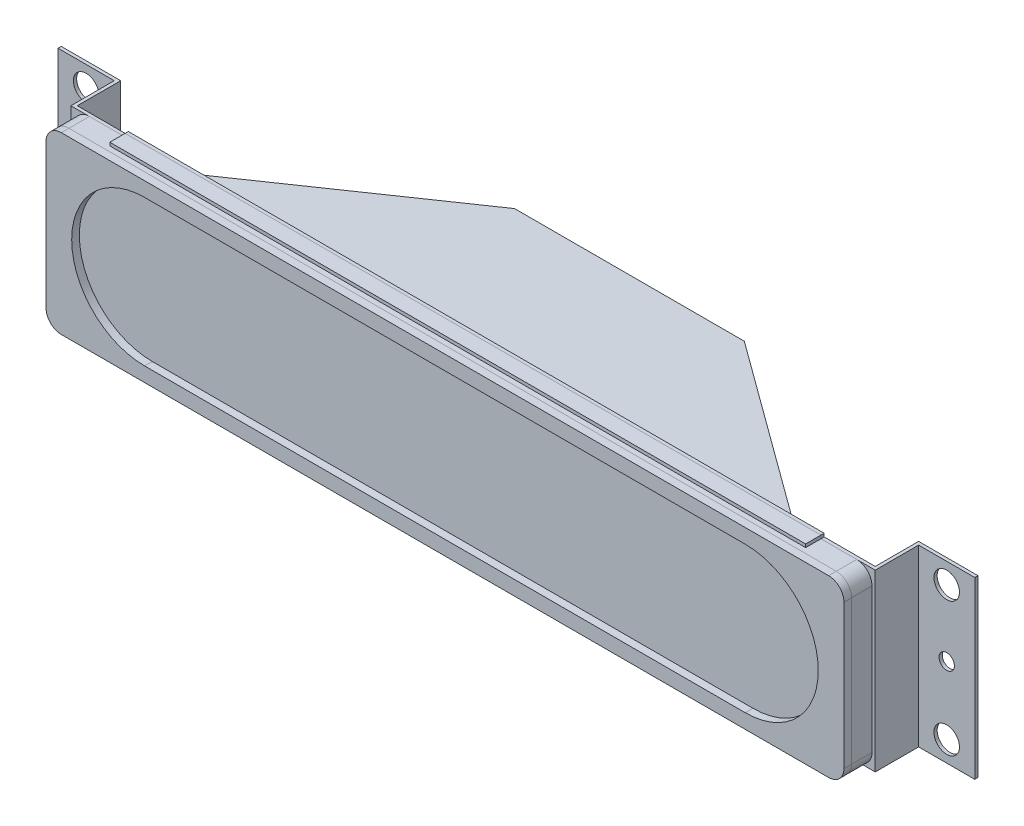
ISO-10303-21;
HEADER;
FILE_DESCRIPTION(('STEP AP214'),'2;1');
FILE_NAME('part.step','',(''),(''),'','','');
FILE_SCHEMA(('AUTOMOTIVE_DESIGN { 1 0 10303 214 1 1 1 1 }'));
ENDSEC;
DATA;
#1=APPLICATION_CONTEXT('core data for automotive mechanical design processes');
#2=APPLICATION_PROTOCOL_DEFINITION('international standard','automotive_design',2000,#1);
#3=PRODUCT_CONTEXT('',#1,'mechanical');
#4=PRODUCT('Part','Part','',(#3));
#5=PRODUCT_RELATED_PRODUCT_CATEGORY('part','',(#4));
#6=PRODUCT_DEFINITION_FORMATION('','',#4);
#7=PRODUCT_DEFINITION_CONTEXT('part definition',#1,'design');
#8=PRODUCT_DEFINITION('design','',#6,#7);
#9=PRODUCT_DEFINITION_SHAPE('','',#8);
#10=(LENGTH_UNIT() NAMED_UNIT(*) SI_UNIT(.MILLI.,.METRE.));
#11=(NAMED_UNIT(*) PLANE_ANGLE_UNIT() SI_UNIT($,.RADIAN.));
#12=(NAMED_UNIT(*) SI_UNIT($,.STERADIAN.) SOLID_ANGLE_UNIT());
#13=UNCERTAINTY_MEASURE_WITH_UNIT(LENGTH_MEASURE(1.E-05),#10,'distance_accuracy_value','');
#14=(GEOMETRIC_REPRESENTATION_CONTEXT(3) GLOBAL_UNCERTAINTY_ASSIGNED_CONTEXT((#13)) GLOBAL_UNIT_ASSIGNED_CONTEXT((#10,
#11,#12)) REPRESENTATION_CONTEXT('',''));
#15=CARTESIAN_POINT('',(0.,0.,0.));
#16=DIRECTION('',(0.,0.,1.));
#17=DIRECTION('',(1.,0.,0.));
#18=AXIS2_PLACEMENT_3D('',#15,#16,#17);
#19=CARTESIAN_POINT('',(0.,0.,-0.63));
#20=DIRECTION('',(0.,0.,-1.));
#21=DIRECTION('',(-1.,0.,0.));
#22=AXIS2_PLACEMENT_3D('',#19,#20,#21);
#23=PLANE('',#22);
#24=DIRECTION('',(1.,0.,0.));
#25=VECTOR('',#24,1.);
#26=CARTESIAN_POINT('',(0.,-34.24,-0.63));
#27=LINE('',#26,#25);
#28=CARTESIAN_POINT('',(0.,-34.24,-0.63));
#29=VERTEX_POINT('',#28);
#30=CARTESIAN_POINT('',(10.,-34.24,-0.63));
#31=VERTEX_POINT('',#30);
#32=EDGE_CURVE('E462',#29,#31,#27,.T.);
#33=ORIENTED_EDGE('',*,*,#32,.F.);
#34=DIRECTION('',(0.,-1.,0.));
#35=VECTOR('',#34,1.);
#36=CARTESIAN_POINT('',(0.,0.,-0.63));
#37=LINE('',#36,#35);
#38=CARTESIAN_POINT('',(0.,0.,-0.63));
#39=VERTEX_POINT('',#38);
#40=EDGE_CURVE('E421',#39,#29,#37,.T.);
#41=ORIENTED_EDGE('',*,*,#40,.F.);
#42=DIRECTION('',(1.,0.,0.));
#43=VECTOR('',#42,1.);
#44=CARTESIAN_POINT('',(0.,0.,-0.63));
#45=LINE('',#44,#43);
#46=CARTESIAN_POINT('',(10.,0.,-0.63));
#47=VERTEX_POINT('',#46);
#48=EDGE_CURVE('E464',#39,#47,#45,.T.);
#49=ORIENTED_EDGE('',*,*,#48,.T.);
#50=DIRECTION('',(0.,1.,0.));
#51=VECTOR('',#50,1.);
#52=CARTESIAN_POINT('',(10.,-1.37676466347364E-13,-0.63));
#53=LINE('',#52,#51);
#54=CARTESIAN_POINT('',(10.,0.630000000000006,-0.63));
#55=VERTEX_POINT('',#54);
#56=EDGE_CURVE('E466',#47,#55,#53,.T.);
#57=ORIENTED_EDGE('',*,*,#56,.T.);
#58=DIRECTION('',(1.,0.,0.));
#59=VECTOR('',#58,1.);
#60=CARTESIAN_POINT('',(0.,0.630000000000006,-0.63));
#61=LINE('',#60,#59);
#62=CARTESIAN_POINT('',(146.28,0.629999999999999,-0.63));
#63=VERTEX_POINT('',#62);
#64=EDGE_CURVE('E468',#55,#63,#61,.T.);
#65=ORIENTED_EDGE('',*,*,#64,.T.);
#66=DIRECTION('',(0.,1.,0.));
#67=VECTOR('',#66,1.);
#68=CARTESIAN_POINT('',(146.28,0.,-0.63));
#69=LINE('',#68,#67);
#70=CARTESIAN_POINT('',(146.28,0.,-0.63));
#71=VERTEX_POINT('',#70);
#72=EDGE_CURVE('E470',#71,#63,#69,.T.);
#73=ORIENTED_EDGE('',*,*,#72,.F.);
#74=DIRECTION('',(1.,0.,0.));
#75=VECTOR('',#74,1.);
#76=CARTESIAN_POINT('',(0.,0.,-0.63));
#77=LINE('',#76,#75);
#78=CARTESIAN_POINT('',(156.28,0.,-0.63));
#79=VERTEX_POINT('',#78);
#80=EDGE_CURVE('E473',#71,#79,#77,.T.);
#81=ORIENTED_EDGE('',*,*,#80,.T.);
#82=DIRECTION('',(0.,1.,0.));
#83=VECTOR('',#82,1.);
#84=CARTESIAN_POINT('',(156.28,0.,-0.63));
#85=LINE('',#84,#83);
#86=CARTESIAN_POINT('',(156.28,-34.24,-0.63));
#87=VERTEX_POINT('',#86);
#88=EDGE_CURVE('E434',#87,#79,#85,.T.);
#89=ORIENTED_EDGE('',*,*,#88,.F.);
#90=DIRECTION('',(1.,0.,0.));
#91=VECTOR('',#90,1.);
#92=CARTESIAN_POINT('',(0.,-34.24,-0.63));
#93=LINE('',#92,#91);
#94=CARTESIAN_POINT('',(146.28,-34.24,-0.63));
#95=VERTEX_POINT('',#94);
#96=EDGE_CURVE('E450',#95,#87,#93,.T.);
#97=ORIENTED_EDGE('',*,*,#96,.F.);
#98=DIRECTION('',(0.,-1.,0.));
#99=VECTOR('',#98,1.);
#100=CARTESIAN_POINT('',(146.28,0.,-0.63));
#101=LINE('',#100,#99);
#102=CARTESIAN_POINT('',(146.28,-34.87,-0.63));
#103=VERTEX_POINT('',#102);
#104=EDGE_CURVE('E453',#95,#103,#101,.T.);
#105=ORIENTED_EDGE('',*,*,#104,.T.);
#106=DIRECTION('',(1.,0.,0.));
#107=VECTOR('',#106,1.);
#108=CARTESIAN_POINT('',(0.,-34.87,-0.63));
#109=LINE('',#108,#107);
#110=CARTESIAN_POINT('',(10.,-34.87,-0.63));
#111=VERTEX_POINT('',#110);
#112=EDGE_CURVE('E456',#111,#103,#109,.T.);
#113=ORIENTED_EDGE('',*,*,#112,.F.);
#114=DIRECTION('',(0.,-1.,0.));
#115=VECTOR('',#114,1.);
#116=CARTESIAN_POINT('',(10.,0.,-0.63));
#117=LINE('',#116,#115);
#118=EDGE_CURVE('E459',#31,#111,#117,.T.);
#119=ORIENTED_EDGE('',*,*,#118,.F.);
#120=EDGE_LOOP('',(#33,#41,#49,#57,#65,#73,#81,#89,#97,#105,#113,#119));
#121=FACE_BOUND('',#120,.T.);
#122=DIRECTION('',(-1.,0.,0.));
#123=VECTOR('',#122,1.);
#124=CARTESIAN_POINT('',(141.28,-30.87,-0.63));
#125=LINE('',#124,#123);
#126=CARTESIAN_POINT('',(141.28,-30.87,-0.63));
#127=VERTEX_POINT('',#126);
#128=CARTESIAN_POINT('',(15.,-30.87,-0.63));
#129=VERTEX_POINT('',#128);
#130=EDGE_CURVE('E230',#127,#129,#125,.T.);
#131=ORIENTED_EDGE('',*,*,#130,.F.);
#132=DIRECTION('',(0.,-1.,0.));
#133=VECTOR('',#132,1.);
#134=CARTESIAN_POINT('',(141.28,-30.87,-0.63));
#135=LINE('',#134,#133);
#136=CARTESIAN_POINT('',(141.28,-3.36999999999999,-0.63));
#137=VERTEX_POINT('',#136);
#138=EDGE_CURVE('E240',#137,#127,#135,.T.);
#139=ORIENTED_EDGE('',*,*,#138,.F.);
#140=DIRECTION('',(1.,0.,0.));
#141=VECTOR('',#140,1.);
#142=CARTESIAN_POINT('',(141.28,-3.36999999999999,-0.63));
#143=LINE('',#142,#141);
#144=CARTESIAN_POINT('',(15.,-3.37,-0.63));
#145=VERTEX_POINT('',#144);
#146=EDGE_CURVE('E238',#145,#137,#143,.T.);
#147=ORIENTED_EDGE('',*,*,#146,.F.);
#148=DIRECTION('',(0.,1.,0.));
#149=VECTOR('',#148,1.);
#150=CARTESIAN_POINT('',(15.,-30.87,-0.63));
#151=LINE('',#150,#149);
#152=EDGE_CURVE('E226',#129,#145,#151,.T.);
#153=ORIENTED_EDGE('',*,*,#152,.F.);
#154=EDGE_LOOP('',(#131,#139,#147,#153));
#155=FACE_BOUND('',#154,.T.);
#156=ADVANCED_FACE('F57',(#121,#155),#23,.T.);
#157=CARTESIAN_POINT('',(156.91,0.,-0.63));
#158=DIRECTION('',(1.,0.,0.));
#159=DIRECTION('',(0.,0.,-1.));
#160=AXIS2_PLACEMENT_3D('',#157,#158,#159);
#161=PLANE('',#160);
#162=DIRECTION('',(0.,0.,1.));
#163=VECTOR('',#162,1.);
#164=CARTESIAN_POINT('',(156.91,-34.24,-0.63));
#165=LINE('',#164,#163);
#166=CARTESIAN_POINT('',(156.91,-34.24,-8.5));
#167=VERTEX_POINT('',#166);
#168=CARTESIAN_POINT('',(156.91,-34.24,0.));
#169=VERTEX_POINT('',#168);
#170=EDGE_CURVE('E475',#167,#169,#165,.T.);
#171=ORIENTED_EDGE('',*,*,#170,.F.);
#172=DIRECTION('',(0.,1.,0.));
#173=VECTOR('',#172,1.);
#174=CARTESIAN_POINT('',(156.91,-34.24,-8.5));
#175=LINE('',#174,#173);
#176=CARTESIAN_POINT('',(156.91,0.,-8.5));
#177=VERTEX_POINT('',#176);
#178=EDGE_CURVE('E337',#167,#177,#175,.T.);
#179=ORIENTED_EDGE('',*,*,#178,.T.);
#180=DIRECTION('',(0.,0.,1.));
#181=VECTOR('',#180,1.);
#182=CARTESIAN_POINT('',(156.91,0.,-0.63));
#183=LINE('',#182,#181);
#184=CARTESIAN_POINT('',(156.91,0.,0.));
#185=VERTEX_POINT('',#184);
#186=EDGE_CURVE('E509',#177,#185,#183,.T.);
#187=ORIENTED_EDGE('',*,*,#186,.T.);
#188=DIRECTION('',(0.,1.,0.));
#189=VECTOR('',#188,1.);
#190=CARTESIAN_POINT('',(156.91,0.,0.));
#191=LINE('',#190,#189);
#192=EDGE_CURVE('E454',#169,#185,#191,.T.);
#193=ORIENTED_EDGE('',*,*,#192,.F.);
#194=EDGE_LOOP('',(#171,#179,#187,#193));
#195=FACE_BOUND('',#194,.T.);
#196=ADVANCED_FACE('F558',(#195),#161,.T.);
#197=CARTESIAN_POINT('',(-0.629999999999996,0.,-0.63));
#198=DIRECTION('',(1.,0.,0.));
#199=DIRECTION('',(0.,1.,0.));
#200=AXIS2_PLACEMENT_3D('',#197,#198,#199);
#201=PLANE('',#200);
#202=DIRECTION('',(0.,1.,0.));
#203=VECTOR('',#202,1.);
#204=CARTESIAN_POINT('',(-0.629999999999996,0.,-8.5));
#205=LINE('',#204,#203);
#206=CARTESIAN_POINT('',(-0.63,-34.24,-8.5));
#207=VERTEX_POINT('',#206);
#208=CARTESIAN_POINT('',(-0.629999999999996,0.,-8.5));
#209=VERTEX_POINT('',#208);
#210=EDGE_CURVE('E401',#207,#209,#205,.T.);
#211=ORIENTED_EDGE('',*,*,#210,.F.);
#212=DIRECTION('',(0.,0.,1.));
#213=VECTOR('',#212,1.);
#214=CARTESIAN_POINT('',(-0.63,-34.24,-0.63));
#215=LINE('',#214,#213);
#216=CARTESIAN_POINT('',(-0.63,-34.24,0.));
#217=VERTEX_POINT('',#216);
#218=EDGE_CURVE('E523',#207,#217,#215,.T.);
#219=ORIENTED_EDGE('',*,*,#218,.T.);
#220=DIRECTION('',(0.,1.,0.));
#221=VECTOR('',#220,1.);
#222=CARTESIAN_POINT('',(-0.629999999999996,0.,0.));
#223=LINE('',#222,#221);
#224=CARTESIAN_POINT('',(-0.629999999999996,0.,0.));
#225=VERTEX_POINT('',#224);
#226=EDGE_CURVE('E490',#217,#225,#223,.T.);
#227=ORIENTED_EDGE('',*,*,#226,.T.);
#228=DIRECTION('',(0.,0.,1.));
#229=VECTOR('',#228,1.);
#230=CARTESIAN_POINT('',(-0.629999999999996,0.,-0.63));
#231=LINE('',#230,#229);
#232=EDGE_CURVE('E521',#209,#225,#231,.T.);
#233=ORIENTED_EDGE('',*,*,#232,.F.);
#234=EDGE_LOOP('',(#211,#219,#227,#233));
#235=FACE_BOUND('',#234,.T.);
#236=ADVANCED_FACE('F564',(#235),#201,.F.);
#237=CARTESIAN_POINT('',(0.,-34.24,-0.63));
#238=DIRECTION('',(0.,-1.,0.));
#239=DIRECTION('',(1.,0.,0.));
#240=AXIS2_PLACEMENT_3D('',#237,#238,#239);
#241=PLANE('',#240);
#242=DIRECTION('',(1.,0.,0.));
#243=VECTOR('',#242,1.);
#244=CARTESIAN_POINT('',(0.,-34.24,0.));
#245=LINE('',#244,#243);
#246=CARTESIAN_POINT('',(146.28,-34.24,0.));
#247=VERTEX_POINT('',#246);
#248=EDGE_CURVE('E449',#247,#169,#245,.T.);
#249=ORIENTED_EDGE('',*,*,#248,.F.);
#250=DIRECTION('',(0.,0.,1.));
#251=VECTOR('',#250,1.);
#252=CARTESIAN_POINT('',(146.28,-34.24,-0.63));
#253=LINE('',#252,#251);
#254=EDGE_CURVE('E13',#95,#247,#253,.T.);
#255=ORIENTED_EDGE('',*,*,#254,.F.);
#256=ORIENTED_EDGE('',*,*,#96,.T.);
#257=DIRECTION('',(0.,0.,1.));
#258=VECTOR('',#257,1.);
#259=CARTESIAN_POINT('',(156.28,-34.24,-9.13));
#260=LINE('',#259,#258);
#261=CARTESIAN_POINT('',(156.28,-34.24,-9.13));
#262=VERTEX_POINT('',#261);
#263=EDGE_CURVE('E446',#262,#87,#260,.T.);
#264=ORIENTED_EDGE('',*,*,#263,.F.);
#265=DIRECTION('',(-1.,0.,0.));
#266=VECTOR('',#265,1.);
#267=CARTESIAN_POINT('',(156.91,-34.24,-9.13));
#268=LINE('',#267,#266);
#269=CARTESIAN_POINT('',(167.91,-34.24,-9.13));
#270=VERTEX_POINT('',#269);
#271=EDGE_CURVE('E435',#270,#262,#268,.T.);
#272=ORIENTED_EDGE('',*,*,#271,.F.);
#273=DIRECTION('',(0.,0.,1.));
#274=VECTOR('',#273,1.);
#275=CARTESIAN_POINT('',(167.91,-34.24,-9.13));
#276=LINE('',#275,#274);
#277=CARTESIAN_POINT('',(167.91,-34.24,-8.5));
#278=VERTEX_POINT('',#277);
#279=EDGE_CURVE('E383',#270,#278,#276,.T.);
#280=ORIENTED_EDGE('',*,*,#279,.T.);
#281=DIRECTION('',(-1.,0.,0.));
#282=VECTOR('',#281,1.);
#283=CARTESIAN_POINT('',(167.91,-34.24,-8.5));
#284=LINE('',#283,#282);
#285=EDGE_CURVE('E398',#278,#167,#284,.T.);
#286=ORIENTED_EDGE('',*,*,#285,.T.);
#287=ORIENTED_EDGE('',*,*,#170,.T.);
#288=EDGE_LOOP('',(#249,#255,#256,#264,#272,#280,#286,#287));
#289=FACE_BOUND('',#288,.T.);
#290=ADVANCED_FACE('F59',(#289),#241,.T.);
#291=CARTESIAN_POINT('',(146.28,0.,-0.63));
#292=DIRECTION('',(-1.,0.,0.));
#293=DIRECTION('',(0.,0.,1.));
#294=AXIS2_PLACEMENT_3D('',#291,#292,#293);
#295=PLANE('',#294);
#296=DIRECTION('',(0.,-1.,0.));
#297=VECTOR('',#296,1.);
#298=CARTESIAN_POINT('',(146.28,0.,0.));
#299=LINE('',#298,#297);
#300=CARTESIAN_POINT('',(146.28,-34.87,0.));
#301=VERTEX_POINT('',#300);
#302=EDGE_CURVE('E478',#247,#301,#299,.T.);
#303=ORIENTED_EDGE('',*,*,#302,.T.);
#304=DIRECTION('',(0.,0.,1.));
#305=VECTOR('',#304,1.);
#306=CARTESIAN_POINT('',(146.28,-34.87,-0.63));
#307=LINE('',#306,#305);
#308=EDGE_CURVE('E66',#103,#301,#307,.T.);
#309=ORIENTED_EDGE('',*,*,#308,.F.);
#310=ORIENTED_EDGE('',*,*,#104,.F.);
#311=ORIENTED_EDGE('',*,*,#254,.T.);
#312=EDGE_LOOP('',(#303,#309,#310,#311));
#313=FACE_BOUND('',#312,.T.);
#314=ADVANCED_FACE('F609',(#313),#295,.F.);
#315=CARTESIAN_POINT('',(0.,-34.87,-0.63));
#316=DIRECTION('',(0.,-1.,0.));
#317=DIRECTION('',(1.,0.,0.));
#318=AXIS2_PLACEMENT_3D('',#315,#316,#317);
#319=PLANE('',#318);
#320=DIRECTION('',(1.,0.,0.));
#321=VECTOR('',#320,1.);
#322=CARTESIAN_POINT('',(0.,-34.87,0.));
#323=LINE('',#322,#321);
#324=CARTESIAN_POINT('',(10.,-34.87,0.));
#325=VERTEX_POINT('',#324);
#326=EDGE_CURVE('E481',#325,#301,#323,.T.);
#327=ORIENTED_EDGE('',*,*,#326,.F.);
#328=DIRECTION('',(0.,0.,1.));
#329=VECTOR('',#328,1.);
#330=CARTESIAN_POINT('',(10.,-34.87,-0.63));
#331=LINE('',#330,#329);
#332=EDGE_CURVE('E527',#111,#325,#331,.T.);
#333=ORIENTED_EDGE('',*,*,#332,.F.);
#334=ORIENTED_EDGE('',*,*,#112,.T.);
#335=ORIENTED_EDGE('',*,*,#308,.T.);
#336=EDGE_LOOP('',(#327,#333,#334,#335));
#337=FACE_BOUND('',#336,.T.);
#338=ADVANCED_FACE('F606',(#337),#319,.T.);
#339=CARTESIAN_POINT('',(10.,0.,-0.63));
#340=DIRECTION('',(-1.,0.,0.));
#341=DIRECTION('',(0.,0.,1.));
#342=AXIS2_PLACEMENT_3D('',#339,#340,#341);
#343=PLANE('',#342);
#344=DIRECTION('',(0.,-1.,0.));
#345=VECTOR('',#344,1.);
#346=CARTESIAN_POINT('',(10.,0.,0.));
#347=LINE('',#346,#345);
#348=CARTESIAN_POINT('',(10.,-34.24,0.));
#349=VERTEX_POINT('',#348);
#350=EDGE_CURVE('E484',#349,#325,#347,.T.);
#351=ORIENTED_EDGE('',*,*,#350,.F.);
#352=DIRECTION('',(0.,0.,1.));
#353=VECTOR('',#352,1.);
#354=CARTESIAN_POINT('',(10.,-34.24,-0.63));
#355=LINE('',#354,#353);
#356=EDGE_CURVE('E525',#31,#349,#355,.T.);
#357=ORIENTED_EDGE('',*,*,#356,.F.);
#358=ORIENTED_EDGE('',*,*,#118,.T.);
#359=ORIENTED_EDGE('',*,*,#332,.T.);
#360=EDGE_LOOP('',(#351,#357,#358,#359));
#361=FACE_BOUND('',#360,.T.);
#362=ADVANCED_FACE('F602',(#361),#343,.T.);
#363=CARTESIAN_POINT('',(0.,-34.24,-0.63));
#364=DIRECTION('',(0.,-1.,0.));
#365=DIRECTION('',(1.,0.,0.));
#366=AXIS2_PLACEMENT_3D('',#363,#364,#365);
#367=PLANE('',#366);
#368=DIRECTION('',(1.,0.,0.));
#369=VECTOR('',#368,1.);
#370=CARTESIAN_POINT('',(0.,-34.24,0.));
#371=LINE('',#370,#369);
#372=EDGE_CURVE('E487',#217,#349,#371,.T.);
#373=ORIENTED_EDGE('',*,*,#372,.F.);
#374=ORIENTED_EDGE('',*,*,#218,.F.);
#375=DIRECTION('',(1.,0.,0.));
#376=VECTOR('',#375,1.);
#377=CARTESIAN_POINT('',(-11.63,-34.24,-8.5));
#378=LINE('',#377,#376);
#379=CARTESIAN_POINT('',(-11.63,-34.24,-8.5));
#380=VERTEX_POINT('',#379);
#381=EDGE_CURVE('E418',#380,#207,#378,.T.);
#382=ORIENTED_EDGE('',*,*,#381,.F.);
#383=DIRECTION('',(0.,0.,1.));
#384=VECTOR('',#383,1.);
#385=CARTESIAN_POINT('',(-11.63,-34.24,-9.13));
#386=LINE('',#385,#384);
#387=CARTESIAN_POINT('',(-11.63,-34.24,-9.13));
#388=VERTEX_POINT('',#387);
#389=EDGE_CURVE('E406',#388,#380,#386,.T.);
#390=ORIENTED_EDGE('',*,*,#389,.F.);
#391=DIRECTION('',(-1.,0.,0.));
#392=VECTOR('',#391,1.);
#393=CARTESIAN_POINT('',(-0.63,-34.24,-9.13));
#394=LINE('',#393,#392);
#395=CARTESIAN_POINT('',(0.,-34.24,-9.13));
#396=VERTEX_POINT('',#395);
#397=EDGE_CURVE('E426',#396,#388,#394,.T.);
#398=ORIENTED_EDGE('',*,*,#397,.F.);
#399=DIRECTION('',(0.,0.,1.));
#400=VECTOR('',#399,1.);
#401=CARTESIAN_POINT('',(0.,-34.24,-9.13));
#402=LINE('',#401,#400);
#403=EDGE_CURVE('E428',#396,#29,#402,.T.);
#404=ORIENTED_EDGE('',*,*,#403,.T.);
#405=ORIENTED_EDGE('',*,*,#32,.T.);
#406=ORIENTED_EDGE('',*,*,#356,.T.);
#407=EDGE_LOOP('',(#373,#374,#382,#390,#398,#404,#405,#406));
#408=FACE_BOUND('',#407,.T.);
#409=ADVANCED_FACE('F595',(#408),#367,.T.);
#410=CARTESIAN_POINT('',(0.,0.,-0.63));
#411=DIRECTION('',(0.,-1.,0.));
#412=DIRECTION('',(1.,0.,0.));
#413=AXIS2_PLACEMENT_3D('',#410,#411,#412);
#414=PLANE('',#413);
#415=DIRECTION('',(1.,0.,0.));
#416=VECTOR('',#415,1.);
#417=CARTESIAN_POINT('',(0.,0.,0.));
#418=LINE('',#417,#416);
#419=CARTESIAN_POINT('',(10.,0.,0.));
#420=VERTEX_POINT('',#419);
#421=EDGE_CURVE('E493',#225,#420,#418,.T.);
#422=ORIENTED_EDGE('',*,*,#421,.T.);
#423=DIRECTION('',(0.,0.,1.));
#424=VECTOR('',#423,1.);
#425=CARTESIAN_POINT('',(10.,0.,-0.63));
#426=LINE('',#425,#424);
#427=EDGE_CURVE('E518',#47,#420,#426,.T.);
#428=ORIENTED_EDGE('',*,*,#427,.F.);
#429=ORIENTED_EDGE('',*,*,#48,.F.);
#430=DIRECTION('',(0.,0.,1.));
#431=VECTOR('',#430,1.);
#432=CARTESIAN_POINT('',(0.,0.,-9.13));
#433=LINE('',#432,#431);
#434=CARTESIAN_POINT('',(0.,0.,-9.13));
#435=VERTEX_POINT('',#434);
#436=EDGE_CURVE('E432',#435,#39,#433,.T.);
#437=ORIENTED_EDGE('',*,*,#436,.F.);
#438=DIRECTION('',(1.,0.,0.));
#439=VECTOR('',#438,1.);
#440=CARTESIAN_POINT('',(-0.629999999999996,0.,-9.13));
#441=LINE('',#440,#439);
#442=CARTESIAN_POINT('',(-11.63,0.,-9.13));
#443=VERTEX_POINT('',#442);
#444=EDGE_CURVE('E422',#443,#435,#441,.T.);
#445=ORIENTED_EDGE('',*,*,#444,.F.);
#446=DIRECTION('',(0.,0.,-1.));
#447=VECTOR('',#446,1.);
#448=CARTESIAN_POINT('',(-11.63,0.,-9.13));
#449=LINE('',#448,#447);
#450=CARTESIAN_POINT('',(-11.63,0.,-8.5));
#451=VERTEX_POINT('',#450);
#452=EDGE_CURVE('E410',#451,#443,#449,.T.);
#453=ORIENTED_EDGE('',*,*,#452,.F.);
#454=DIRECTION('',(1.,0.,0.));
#455=VECTOR('',#454,1.);
#456=CARTESIAN_POINT('',(-11.63,0.,-8.5));
#457=LINE('',#456,#455);
#458=EDGE_CURVE('E413',#451,#209,#457,.T.);
#459=ORIENTED_EDGE('',*,*,#458,.T.);
#460=ORIENTED_EDGE('',*,*,#232,.T.);
#461=EDGE_LOOP('',(#422,#428,#429,#437,#445,#453,#459,#460));
#462=FACE_BOUND('',#461,.T.);
#463=ADVANCED_FACE('F591',(#462),#414,.F.);
#464=CARTESIAN_POINT('',(10.,-1.37676466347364E-13,-0.63));
#465=DIRECTION('',(1.,0.,0.));
#466=DIRECTION('',(0.,1.,0.));
#467=AXIS2_PLACEMENT_3D('',#464,#465,#466);
#468=PLANE('',#467);
#469=DIRECTION('',(0.,1.,0.));
#470=VECTOR('',#469,1.);
#471=CARTESIAN_POINT('',(10.,-1.37676466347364E-13,0.));
#472=LINE('',#471,#470);
#473=CARTESIAN_POINT('',(10.,0.630000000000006,0.));
#474=VERTEX_POINT('',#473);
#475=EDGE_CURVE('E495',#420,#474,#472,.T.);
#476=ORIENTED_EDGE('',*,*,#475,.T.);
#477=DIRECTION('',(0.,0.,1.));
#478=VECTOR('',#477,1.);
#479=CARTESIAN_POINT('',(10.,0.630000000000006,-0.63));
#480=LINE('',#479,#478);
#481=EDGE_CURVE('E515',#55,#474,#480,.T.);
#482=ORIENTED_EDGE('',*,*,#481,.F.);
#483=ORIENTED_EDGE('',*,*,#56,.F.);
#484=ORIENTED_EDGE('',*,*,#427,.T.);
#485=EDGE_LOOP('',(#476,#482,#483,#484));
#486=FACE_BOUND('',#485,.T.);
#487=ADVANCED_FACE('F587',(#486),#468,.F.);
#488=CARTESIAN_POINT('',(0.,0.630000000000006,-0.63));
#489=DIRECTION('',(0.,-1.,0.));
#490=DIRECTION('',(1.,0.,0.));
#491=AXIS2_PLACEMENT_3D('',#488,#489,#490);
#492=PLANE('',#491);
#493=DIRECTION('',(1.,0.,0.));
#494=VECTOR('',#493,1.);
#495=CARTESIAN_POINT('',(0.,0.630000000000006,0.));
#496=LINE('',#495,#494);
#497=CARTESIAN_POINT('',(146.28,0.629999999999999,0.));
#498=VERTEX_POINT('',#497);
#499=EDGE_CURVE('E497',#474,#498,#496,.T.);
#500=ORIENTED_EDGE('',*,*,#499,.T.);
#501=DIRECTION('',(0.,0.,1.));
#502=VECTOR('',#501,1.);
#503=CARTESIAN_POINT('',(146.28,0.629999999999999,-0.63));
#504=LINE('',#503,#502);
#505=EDGE_CURVE('E513',#63,#498,#504,.T.);
#506=ORIENTED_EDGE('',*,*,#505,.F.);
#507=ORIENTED_EDGE('',*,*,#64,.F.);
#508=ORIENTED_EDGE('',*,*,#481,.T.);
#509=EDGE_LOOP('',(#500,#506,#507,#508));
#510=FACE_BOUND('',#509,.T.);
#511=ADVANCED_FACE('F583',(#510),#492,.F.);
#512=CARTESIAN_POINT('',(146.28,0.,-0.63));
#513=DIRECTION('',(1.,0.,0.));
#514=DIRECTION('',(0.,0.,-1.));
#515=AXIS2_PLACEMENT_3D('',#512,#513,#514);
#516=PLANE('',#515);
#517=DIRECTION('',(0.,1.,0.));
#518=VECTOR('',#517,1.);
#519=CARTESIAN_POINT('',(146.28,0.,0.));
#520=LINE('',#519,#518);
#521=CARTESIAN_POINT('',(146.28,0.,0.));
#522=VERTEX_POINT('',#521);
#523=EDGE_CURVE('E500',#522,#498,#520,.T.);
#524=ORIENTED_EDGE('',*,*,#523,.F.);
#525=DIRECTION('',(0.,0.,1.));
#526=VECTOR('',#525,1.);
#527=CARTESIAN_POINT('',(146.28,0.,-0.63));
#528=LINE('',#527,#526);
#529=EDGE_CURVE('E511',#71,#522,#528,.T.);
#530=ORIENTED_EDGE('',*,*,#529,.F.);
#531=ORIENTED_EDGE('',*,*,#72,.T.);
#532=ORIENTED_EDGE('',*,*,#505,.T.);
#533=EDGE_LOOP('',(#524,#530,#531,#532));
#534=FACE_BOUND('',#533,.T.);
#535=ADVANCED_FACE('F579',(#534),#516,.T.);
#536=CARTESIAN_POINT('',(0.,0.,-0.63));
#537=DIRECTION('',(0.,-1.,0.));
#538=DIRECTION('',(1.,0.,0.));
#539=AXIS2_PLACEMENT_3D('',#536,#537,#538);
#540=PLANE('',#539);
#541=DIRECTION('',(1.,0.,0.));
#542=VECTOR('',#541,1.);
#543=CARTESIAN_POINT('',(0.,0.,0.));
#544=LINE('',#543,#542);
#545=EDGE_CURVE('E503',#522,#185,#544,.T.);
#546=ORIENTED_EDGE('',*,*,#545,.T.);
#547=ORIENTED_EDGE('',*,*,#186,.F.);
#548=DIRECTION('',(-1.,0.,0.));
#549=VECTOR('',#548,1.);
#550=CARTESIAN_POINT('',(167.91,0.,-8.5));
#551=LINE('',#550,#549);
#552=CARTESIAN_POINT('',(167.91,0.,-8.5));
#553=VERTEX_POINT('',#552);
#554=EDGE_CURVE('E82',#553,#177,#551,.T.);
#555=ORIENTED_EDGE('',*,*,#554,.F.);
#556=DIRECTION('',(0.,0.,1.));
#557=VECTOR('',#556,1.);
#558=CARTESIAN_POINT('',(167.91,0.,-9.13));
#559=LINE('',#558,#557);
#560=CARTESIAN_POINT('',(167.91,0.,-9.13));
#561=VERTEX_POINT('',#560);
#562=EDGE_CURVE('E393',#561,#553,#559,.T.);
#563=ORIENTED_EDGE('',*,*,#562,.F.);
#564=DIRECTION('',(1.,0.,0.));
#565=VECTOR('',#564,1.);
#566=CARTESIAN_POINT('',(156.91,0.,-9.13));
#567=LINE('',#566,#565);
#568=CARTESIAN_POINT('',(156.28,0.,-9.13));
#569=VERTEX_POINT('',#568);
#570=EDGE_CURVE('E439',#569,#561,#567,.T.);
#571=ORIENTED_EDGE('',*,*,#570,.F.);
#572=DIRECTION('',(0.,0.,1.));
#573=VECTOR('',#572,1.);
#574=CARTESIAN_POINT('',(156.28,0.,-9.13));
#575=LINE('',#574,#573);
#576=EDGE_CURVE('E441',#569,#79,#575,.T.);
#577=ORIENTED_EDGE('',*,*,#576,.T.);
#578=ORIENTED_EDGE('',*,*,#80,.F.);
#579=ORIENTED_EDGE('',*,*,#529,.T.);
#580=EDGE_LOOP('',(#546,#547,#555,#563,#571,#577,#578,#579));
#581=FACE_BOUND('',#580,.T.);
#582=ADVANCED_FACE('F574',(#581),#540,.F.);
#583=CARTESIAN_POINT('',(0.,0.,0.));
#584=DIRECTION('',(0.,0.,-1.));
#585=DIRECTION('',(-1.,0.,0.));
#586=AXIS2_PLACEMENT_3D('',#583,#584,#585);
#587=PLANE('',#586);
#588=ORIENTED_EDGE('',*,*,#248,.T.);
#589=ORIENTED_EDGE('',*,*,#192,.T.);
#590=ORIENTED_EDGE('',*,*,#545,.F.);
#591=ORIENTED_EDGE('',*,*,#523,.T.);
#592=ORIENTED_EDGE('',*,*,#499,.F.);
#593=ORIENTED_EDGE('',*,*,#475,.F.);
#594=ORIENTED_EDGE('',*,*,#421,.F.);
#595=ORIENTED_EDGE('',*,*,#226,.F.);
#596=ORIENTED_EDGE('',*,*,#372,.T.);
#597=ORIENTED_EDGE('',*,*,#350,.T.);
#598=ORIENTED_EDGE('',*,*,#326,.T.);
#599=ORIENTED_EDGE('',*,*,#302,.F.);
#600=EDGE_LOOP('',(#588,#589,#590,#591,#592,#593,#594,#595,#596,#597,#598,#599));
#601=FACE_BOUND('',#600,.T.);
#602=ADVANCED_FACE('F572',(#601),#587,.F.);
#603=CARTESIAN_POINT('',(156.28,0.,-9.13));
#604=DIRECTION('',(1.,0.,0.));
#605=DIRECTION('',(0.,0.,-1.));
#606=AXIS2_PLACEMENT_3D('',#603,#604,#605);
#607=PLANE('',#606);
#608=ORIENTED_EDGE('',*,*,#88,.T.);
#609=ORIENTED_EDGE('',*,*,#576,.F.);
#610=DIRECTION('',(0.,1.,0.));
#611=VECTOR('',#610,1.);
#612=CARTESIAN_POINT('',(156.28,0.,-9.13));
#613=LINE('',#612,#611);
#614=EDGE_CURVE('E437',#262,#569,#613,.T.);
#615=ORIENTED_EDGE('',*,*,#614,.F.);
#616=ORIENTED_EDGE('',*,*,#263,.T.);
#617=EDGE_LOOP('',(#608,#609,#615,#616));
#618=FACE_BOUND('',#617,.T.);
#619=ADVANCED_FACE('F570',(#618),#607,.F.);
#620=CARTESIAN_POINT('',(0.,0.,-9.13));
#621=DIRECTION('',(0.,0.,-1.));
#622=DIRECTION('',(-1.,0.,0.));
#623=AXIS2_PLACEMENT_3D('',#620,#621,#622);
#624=PLANE('',#623);
#625=CARTESIAN_POINT('',(162.41,-4.,-9.13));
#626=DIRECTION('',(0.,0.,-1.));
#627=DIRECTION('',(-1.,0.,0.));
#628=AXIS2_PLACEMENT_3D('',#625,#626,#627);
#629=CIRCLE('',#628,2.5);
#630=CARTESIAN_POINT('',(159.91,-4.,-9.13));
#631=VERTEX_POINT('',#630);
#632=EDGE_CURVE('E252',#631,#631,#629,.T.);
#633=ORIENTED_EDGE('',*,*,#632,.F.);
#634=EDGE_LOOP('',(#633));
#635=FACE_BOUND('',#634,.T.);
#636=CARTESIAN_POINT('',(162.41,-17.,-9.13));
#637=DIRECTION('',(0.,0.,-1.));
#638=DIRECTION('',(-1.,0.,0.));
#639=AXIS2_PLACEMENT_3D('',#636,#637,#638);
#640=CIRCLE('',#639,1.5);
#641=CARTESIAN_POINT('',(160.91,-17.,-9.13));
#642=VERTEX_POINT('',#641);
#643=EDGE_CURVE('E270',#642,#642,#640,.T.);
#644=ORIENTED_EDGE('',*,*,#643,.F.);
#645=EDGE_LOOP('',(#644));
#646=FACE_BOUND('',#645,.T.);
#647=CARTESIAN_POINT('',(162.41,-30.24,-9.13));
#648=DIRECTION('',(0.,0.,-1.));
#649=DIRECTION('',(-1.,0.,0.));
#650=AXIS2_PLACEMENT_3D('',#647,#648,#649);
#651=CIRCLE('',#650,2.5);
#652=CARTESIAN_POINT('',(159.91,-30.24,-9.13));
#653=VERTEX_POINT('',#652);
#654=EDGE_CURVE('E266',#653,#653,#651,.T.);
#655=ORIENTED_EDGE('',*,*,#654,.F.);
#656=EDGE_LOOP('',(#655));
#657=FACE_BOUND('',#656,.T.);
#658=ORIENTED_EDGE('',*,*,#570,.T.);
#659=DIRECTION('',(0.,1.,0.));
#660=VECTOR('',#659,1.);
#661=CARTESIAN_POINT('',(167.91,-34.24,-9.13));
#662=LINE('',#661,#660);
#663=EDGE_CURVE('E395',#270,#561,#662,.T.);
#664=ORIENTED_EDGE('',*,*,#663,.F.);
#665=ORIENTED_EDGE('',*,*,#271,.T.);
#666=ORIENTED_EDGE('',*,*,#614,.T.);
#667=EDGE_LOOP('',(#658,#664,#665,#666));
#668=FACE_BOUND('',#667,.T.);
#669=ADVANCED_FACE('F672',(#635,#646,#657,#668),#624,.T.);
#670=CARTESIAN_POINT('',(0.,0.,-9.13));
#671=DIRECTION('',(-1.,0.,0.));
#672=DIRECTION('',(0.,-1.,0.));
#673=AXIS2_PLACEMENT_3D('',#670,#671,#672);
#674=PLANE('',#673);
#675=ORIENTED_EDGE('',*,*,#40,.T.);
#676=ORIENTED_EDGE('',*,*,#403,.F.);
#677=DIRECTION('',(0.,-1.,0.));
#678=VECTOR('',#677,1.);
#679=CARTESIAN_POINT('',(0.,0.,-9.13));
#680=LINE('',#679,#678);
#681=EDGE_CURVE('E424',#435,#396,#680,.T.);
#682=ORIENTED_EDGE('',*,*,#681,.F.);
#683=ORIENTED_EDGE('',*,*,#436,.T.);
#684=EDGE_LOOP('',(#675,#676,#682,#683));
#685=FACE_BOUND('',#684,.T.);
#686=ADVANCED_FACE('F670',(#685),#674,.F.);
#687=CARTESIAN_POINT('',(0.,0.,-9.13));
#688=DIRECTION('',(0.,0.,1.));
#689=DIRECTION('',(1.,0.,0.));
#690=AXIS2_PLACEMENT_3D('',#687,#688,#689);
#691=PLANE('',#690);
#692=CARTESIAN_POINT('',(-6.13,-4.,-9.13));
#693=DIRECTION('',(0.,0.,1.));
#694=DIRECTION('',(1.,0.,0.));
#695=AXIS2_PLACEMENT_3D('',#692,#693,#694);
#696=CIRCLE('',#695,2.5);
#697=CARTESIAN_POINT('',(-3.63,-4.,-9.13));
#698=VERTEX_POINT('',#697);
#699=EDGE_CURVE('E261',#698,#698,#696,.T.);
#700=ORIENTED_EDGE('',*,*,#699,.T.);
#701=EDGE_LOOP('',(#700));
#702=FACE_BOUND('',#701,.T.);
#703=CARTESIAN_POINT('',(-6.13,-17.,-9.13));
#704=DIRECTION('',(0.,0.,1.));
#705=DIRECTION('',(1.,0.,0.));
#706=AXIS2_PLACEMENT_3D('',#703,#704,#705);
#707=CIRCLE('',#706,1.5);
#708=CARTESIAN_POINT('',(-4.63,-17.,-9.13));
#709=VERTEX_POINT('',#708);
#710=EDGE_CURVE('E730',#709,#709,#707,.T.);
#711=ORIENTED_EDGE('',*,*,#710,.T.);
#712=EDGE_LOOP('',(#711));
#713=FACE_BOUND('',#712,.T.);
#714=CARTESIAN_POINT('',(-6.13,-30.24,-9.13));
#715=DIRECTION('',(0.,0.,1.));
#716=DIRECTION('',(1.,0.,0.));
#717=AXIS2_PLACEMENT_3D('',#714,#715,#716);
#718=CIRCLE('',#717,2.5);
#719=CARTESIAN_POINT('',(-3.63,-30.24,-9.13));
#720=VERTEX_POINT('',#719);
#721=EDGE_CURVE('E733',#720,#720,#718,.T.);
#722=ORIENTED_EDGE('',*,*,#721,.T.);
#723=EDGE_LOOP('',(#722));
#724=FACE_BOUND('',#723,.T.);
#725=ORIENTED_EDGE('',*,*,#397,.T.);
#726=DIRECTION('',(0.,-1.,0.));
#727=VECTOR('',#726,1.);
#728=CARTESIAN_POINT('',(-11.63,0.,-9.13));
#729=LINE('',#728,#727);
#730=EDGE_CURVE('E403',#443,#388,#729,.T.);
#731=ORIENTED_EDGE('',*,*,#730,.F.);
#732=ORIENTED_EDGE('',*,*,#444,.T.);
#733=ORIENTED_EDGE('',*,*,#681,.T.);
#734=EDGE_LOOP('',(#725,#731,#732,#733));
#735=FACE_BOUND('',#734,.T.);
#736=ADVANCED_FACE('F669',(#702,#713,#724,#735),#691,.F.);
#737=CARTESIAN_POINT('',(-11.63,0.,-8.5));
#738=DIRECTION('',(0.,0.,-1.));
#739=DIRECTION('',(0.,1.,0.));
#740=AXIS2_PLACEMENT_3D('',#737,#738,#739);
#741=PLANE('',#740);
#742=CARTESIAN_POINT('',(-6.13,-4.,-8.5));
#743=DIRECTION('',(0.,0.,-1.));
#744=DIRECTION('',(0.,1.,0.));
#745=AXIS2_PLACEMENT_3D('',#742,#743,#744);
#746=CIRCLE('',#745,2.5);
#747=CARTESIAN_POINT('',(-6.13,-1.5,-8.5));
#748=VERTEX_POINT('',#747);
#749=EDGE_CURVE('E61',#748,#748,#746,.F.);
#750=ORIENTED_EDGE('',*,*,#749,.F.);
#751=EDGE_LOOP('',(#750));
#752=FACE_BOUND('',#751,.T.);
#753=CARTESIAN_POINT('',(-6.13,-17.,-8.5));
#754=DIRECTION('',(0.,0.,-1.));
#755=DIRECTION('',(0.,1.,0.));
#756=AXIS2_PLACEMENT_3D('',#753,#754,#755);
#757=CIRCLE('',#756,1.5);
#758=CARTESIAN_POINT('',(-6.13,-15.5,-8.5));
#759=VERTEX_POINT('',#758);
#760=EDGE_CURVE('E260',#759,#759,#757,.F.);
#761=ORIENTED_EDGE('',*,*,#760,.F.);
#762=EDGE_LOOP('',(#761));
#763=FACE_BOUND('',#762,.T.);
#764=CARTESIAN_POINT('',(-6.13,-30.24,-8.5));
#765=DIRECTION('',(0.,0.,-1.));
#766=DIRECTION('',(0.,1.,0.));
#767=AXIS2_PLACEMENT_3D('',#764,#765,#766);
#768=CIRCLE('',#767,2.5);
#769=CARTESIAN_POINT('',(-6.13,-27.74,-8.5));
#770=VERTEX_POINT('',#769);
#771=EDGE_CURVE('E258',#770,#770,#768,.F.);
#772=ORIENTED_EDGE('',*,*,#771,.F.);
#773=EDGE_LOOP('',(#772));
#774=FACE_BOUND('',#773,.T.);
#775=ORIENTED_EDGE('',*,*,#210,.T.);
#776=ORIENTED_EDGE('',*,*,#458,.F.);
#777=DIRECTION('',(0.,1.,0.));
#778=VECTOR('',#777,1.);
#779=CARTESIAN_POINT('',(-11.63,0.,-8.5));
#780=LINE('',#779,#778);
#781=EDGE_CURVE('E408',#380,#451,#780,.T.);
#782=ORIENTED_EDGE('',*,*,#781,.F.);
#783=ORIENTED_EDGE('',*,*,#381,.T.);
#784=EDGE_LOOP('',(#775,#776,#782,#783));
#785=FACE_BOUND('',#784,.T.);
#786=ADVANCED_FACE('F662',(#752,#763,#774,#785),#741,.F.);
#787=CARTESIAN_POINT('',(-11.63,0.,0.));
#788=DIRECTION('',(-1.,0.,0.));
#789=DIRECTION('',(0.,0.,1.));
#790=AXIS2_PLACEMENT_3D('',#787,#788,#789);
#791=PLANE('',#790);
#792=ORIENTED_EDGE('',*,*,#730,.T.);
#793=ORIENTED_EDGE('',*,*,#389,.T.);
#794=ORIENTED_EDGE('',*,*,#781,.T.);
#795=ORIENTED_EDGE('',*,*,#452,.T.);
#796=EDGE_LOOP('',(#792,#793,#794,#795));
#797=FACE_BOUND('',#796,.T.);
#798=ADVANCED_FACE('F666',(#797),#791,.T.);
#799=CARTESIAN_POINT('',(167.91,-34.24,-8.5));
#800=DIRECTION('',(0.,0.,1.));
#801=DIRECTION('',(1.,0.,0.));
#802=AXIS2_PLACEMENT_3D('',#799,#800,#801);
#803=PLANE('',#802);
#804=CARTESIAN_POINT('',(162.41,-4.,-8.5));
#805=DIRECTION('',(0.,0.,1.));
#806=DIRECTION('',(1.,0.,0.));
#807=AXIS2_PLACEMENT_3D('',#804,#805,#806);
#808=CIRCLE('',#807,2.5);
#809=CARTESIAN_POINT('',(164.91,-4.,-8.5));
#810=VERTEX_POINT('',#809);
#811=EDGE_CURVE('E255',#810,#810,#808,.T.);
#812=ORIENTED_EDGE('',*,*,#811,.F.);
#813=EDGE_LOOP('',(#812));
#814=FACE_BOUND('',#813,.T.);
#815=CARTESIAN_POINT('',(162.41,-17.,-8.5));
#816=DIRECTION('',(0.,0.,1.));
#817=DIRECTION('',(1.,0.,0.));
#818=AXIS2_PLACEMENT_3D('',#815,#816,#817);
#819=CIRCLE('',#818,1.5);
#820=CARTESIAN_POINT('',(163.91,-17.,-8.5));
#821=VERTEX_POINT('',#820);
#822=EDGE_CURVE('E251',#821,#821,#819,.T.);
#823=ORIENTED_EDGE('',*,*,#822,.F.);
#824=EDGE_LOOP('',(#823));
#825=FACE_BOUND('',#824,.T.);
#826=CARTESIAN_POINT('',(162.41,-30.24,-8.5));
#827=DIRECTION('',(0.,0.,1.));
#828=DIRECTION('',(1.,0.,0.));
#829=AXIS2_PLACEMENT_3D('',#826,#827,#828);
#830=CIRCLE('',#829,2.5);
#831=CARTESIAN_POINT('',(164.91,-30.24,-8.5));
#832=VERTEX_POINT('',#831);
#833=EDGE_CURVE('E248',#832,#832,#830,.T.);
#834=ORIENTED_EDGE('',*,*,#833,.F.);
#835=EDGE_LOOP('',(#834));
#836=FACE_BOUND('',#835,.T.);
#837=ORIENTED_EDGE('',*,*,#178,.F.);
#838=ORIENTED_EDGE('',*,*,#285,.F.);
#839=DIRECTION('',(0.,1.,0.));
#840=VECTOR('',#839,1.);
#841=CARTESIAN_POINT('',(167.91,-34.24,-8.5));
#842=LINE('',#841,#840);
#843=EDGE_CURVE('E391',#278,#553,#842,.T.);
#844=ORIENTED_EDGE('',*,*,#843,.T.);
#845=ORIENTED_EDGE('',*,*,#554,.T.);
#846=EDGE_LOOP('',(#837,#838,#844,#845));
#847=FACE_BOUND('',#846,.T.);
#848=ADVANCED_FACE('F686',(#814,#825,#836,#847),#803,.T.);
#849=CARTESIAN_POINT('',(167.91,0.,0.));
#850=DIRECTION('',(-1.,0.,0.));
#851=DIRECTION('',(0.,0.,1.));
#852=AXIS2_PLACEMENT_3D('',#849,#850,#851);
#853=PLANE('',#852);
#854=ORIENTED_EDGE('',*,*,#279,.F.);
#855=ORIENTED_EDGE('',*,*,#663,.T.);
#856=ORIENTED_EDGE('',*,*,#562,.T.);
#857=ORIENTED_EDGE('',*,*,#843,.F.);
#858=EDGE_LOOP('',(#854,#855,#856,#857));
#859=FACE_BOUND('',#858,.T.);
#860=ADVANCED_FACE('F357',(#859),#853,.F.);
#861=CARTESIAN_POINT('',(0.,0.,-30.63));
#862=DIRECTION('',(0.,0.,1.));
#863=DIRECTION('',(1.,0.,0.));
#864=AXIS2_PLACEMENT_3D('',#861,#862,#863);
#865=PLANE('',#864);
#866=DIRECTION('',(0.,-1.,0.));
#867=VECTOR('',#866,1.);
#868=CARTESIAN_POINT('',(100.64,-29.62,-30.63));
#869=LINE('',#868,#867);
#870=CARTESIAN_POINT('',(100.64,-4.62,-30.63));
#871=VERTEX_POINT('',#870);
#872=CARTESIAN_POINT('',(100.64,-29.62,-30.63));
#873=VERTEX_POINT('',#872);
#874=EDGE_CURVE('E290',#871,#873,#869,.T.);
#875=ORIENTED_EDGE('',*,*,#874,.T.);
#876=DIRECTION('',(-1.,0.,0.));
#877=VECTOR('',#876,1.);
#878=CARTESIAN_POINT('',(100.64,-29.62,-30.63));
#879=LINE('',#878,#877);
#880=CARTESIAN_POINT('',(55.64,-29.62,-30.63));
#881=VERTEX_POINT('',#880);
#882=EDGE_CURVE('E294',#873,#881,#879,.T.);
#883=ORIENTED_EDGE('',*,*,#882,.T.);
#884=DIRECTION('',(0.,1.,0.));
#885=VECTOR('',#884,1.);
#886=CARTESIAN_POINT('',(55.64,-29.62,-30.63));
#887=LINE('',#886,#885);
#888=CARTESIAN_POINT('',(55.64,-4.62,-30.63));
#889=VERTEX_POINT('',#888);
#890=EDGE_CURVE('E228',#881,#889,#887,.T.);
#891=ORIENTED_EDGE('',*,*,#890,.T.);
#892=DIRECTION('',(1.,0.,0.));
#893=VECTOR('',#892,1.);
#894=CARTESIAN_POINT('',(100.64,-4.62,-30.63));
#895=LINE('',#894,#893);
#896=EDGE_CURVE('E373',#889,#871,#895,.T.);
#897=ORIENTED_EDGE('',*,*,#896,.T.);
#898=EDGE_LOOP('',(#875,#883,#891,#897));
#899=FACE_BOUND('',#898,.T.);
#900=ADVANCED_FACE('F310',(#899),#865,.F.);
#901=CARTESIAN_POINT('',(0.,-30.8427036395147,-1.28511265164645));
#902=DIRECTION('',(0.,0.999133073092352,0.0416305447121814));
#903=DIRECTION('',(0.,-0.0416305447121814,0.999133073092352));
#904=AXIS2_PLACEMENT_3D('',#901,#902,#903);
#905=PLANE('',#904);
#906=DIRECTION('',(0.804291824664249,0.0247383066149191,-0.593719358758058));
#907=VECTOR('',#906,1.);
#908=CARTESIAN_POINT('',(15.,-30.87,-0.63));
#909=LINE('',#908,#907);
#910=EDGE_CURVE('E222',#129,#881,#909,.T.);
#911=ORIENTED_EDGE('',*,*,#910,.T.);
#912=ORIENTED_EDGE('',*,*,#882,.F.);
#913=DIRECTION('',(-0.804291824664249,0.0247383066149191,-0.593719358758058));
#914=VECTOR('',#913,1.);
#915=CARTESIAN_POINT('',(141.28,-30.87,-0.63));
#916=LINE('',#915,#914);
#917=EDGE_CURVE('E74',#127,#873,#916,.T.);
#918=ORIENTED_EDGE('',*,*,#917,.F.);
#919=ORIENTED_EDGE('',*,*,#130,.T.);
#920=EDGE_LOOP('',(#911,#912,#918,#919));
#921=FACE_BOUND('',#920,.T.);
#922=ADVANCED_FACE('F233',(#921),#905,.F.);
#923=CARTESIAN_POINT('',(50.1330987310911,0.,-67.9136377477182));
#924=DIRECTION('',(-0.593901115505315,0.,0.8045380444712));
#925=DIRECTION('',(0.8045380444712,0.,0.593901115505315));
#926=AXIS2_PLACEMENT_3D('',#923,#924,#925);
#927=PLANE('',#926);
#928=ORIENTED_EDGE('',*,*,#917,.T.);
#929=ORIENTED_EDGE('',*,*,#874,.F.);
#930=DIRECTION('',(-0.804291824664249,-0.0247383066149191,-0.593719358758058));
#931=VECTOR('',#930,1.);
#932=CARTESIAN_POINT('',(141.28,-3.36999999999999,-0.63));
#933=LINE('',#932,#931);
#934=EDGE_CURVE('E285',#137,#871,#933,.T.);
#935=ORIENTED_EDGE('',*,*,#934,.F.);
#936=ORIENTED_EDGE('',*,*,#138,.T.);
#937=EDGE_LOOP('',(#928,#929,#935,#936));
#938=FACE_BOUND('',#937,.T.);
#939=ADVANCED_FACE('F309',(#938),#927,.F.);
#940=CARTESIAN_POINT('',(4.98975391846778,0.,6.75945330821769));
#941=DIRECTION('',(0.593901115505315,0.,0.8045380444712));
#942=DIRECTION('',(0.8045380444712,0.,-0.593901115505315));
#943=AXIS2_PLACEMENT_3D('',#940,#941,#942);
#944=PLANE('',#943);
#945=DIRECTION('',(0.804291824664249,-0.024738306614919,-0.593719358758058));
#946=VECTOR('',#945,1.);
#947=CARTESIAN_POINT('',(15.,-3.37,-0.63));
#948=LINE('',#947,#946);
#949=EDGE_CURVE('E279',#145,#889,#948,.T.);
#950=ORIENTED_EDGE('',*,*,#949,.T.);
#951=ORIENTED_EDGE('',*,*,#890,.F.);
#952=ORIENTED_EDGE('',*,*,#910,.F.);
#953=ORIENTED_EDGE('',*,*,#152,.T.);
#954=EDGE_LOOP('',(#950,#951,#952,#953));
#955=FACE_BOUND('',#954,.T.);
#956=ADVANCED_FACE('F224',(#955),#944,.F.);
#957=CARTESIAN_POINT('',(0.,-3.33795493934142,0.139081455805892));
#958=DIRECTION('',(0.,-0.999133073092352,0.0416305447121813));
#959=DIRECTION('',(0.,-0.0416305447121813,-0.999133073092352));
#960=AXIS2_PLACEMENT_3D('',#957,#958,#959);
#961=PLANE('',#960);
#962=ORIENTED_EDGE('',*,*,#934,.T.);
#963=ORIENTED_EDGE('',*,*,#896,.F.);
#964=ORIENTED_EDGE('',*,*,#949,.F.);
#965=ORIENTED_EDGE('',*,*,#146,.T.);
#966=EDGE_LOOP('',(#962,#963,#964,#965));
#967=FACE_BOUND('',#966,.T.);
#968=ADVANCED_FACE('F358',(#967),#961,.F.);
#969=CARTESIAN_POINT('',(162.41,-30.24,-3.13));
#970=DIRECTION('',(0.,0.,-1.));
#971=DIRECTION('',(-1.,0.,0.));
#972=AXIS2_PLACEMENT_3D('',#969,#970,#971);
#973=CYLINDRICAL_SURFACE('',#972,2.5);
#974=ORIENTED_EDGE('',*,*,#833,.T.);
#975=EDGE_LOOP('',(#974));
#976=FACE_BOUND('',#975,.T.);
#977=ORIENTED_EDGE('',*,*,#654,.T.);
#978=EDGE_LOOP('',(#977));
#979=FACE_BOUND('',#978,.T.);
#980=ADVANCED_FACE('F311',(#976,#979),#973,.F.);
#981=CARTESIAN_POINT('',(162.41,-17.,-3.13));
#982=DIRECTION('',(0.,0.,-1.));
#983=DIRECTION('',(-1.,0.,0.));
#984=AXIS2_PLACEMENT_3D('',#981,#982,#983);
#985=CYLINDRICAL_SURFACE('',#984,1.5);
#986=ORIENTED_EDGE('',*,*,#822,.T.);
#987=EDGE_LOOP('',(#986));
#988=FACE_BOUND('',#987,.T.);
#989=ORIENTED_EDGE('',*,*,#643,.T.);
#990=EDGE_LOOP('',(#989));
#991=FACE_BOUND('',#990,.T.);
#992=ADVANCED_FACE('F555',(#988,#991),#985,.F.);
#993=CARTESIAN_POINT('',(162.41,-4.,-3.13));
#994=DIRECTION('',(0.,0.,-1.));
#995=DIRECTION('',(-1.,0.,0.));
#996=AXIS2_PLACEMENT_3D('',#993,#994,#995);
#997=CYLINDRICAL_SURFACE('',#996,2.5);
#998=ORIENTED_EDGE('',*,*,#811,.T.);
#999=EDGE_LOOP('',(#998));
#1000=FACE_BOUND('',#999,.T.);
#1001=ORIENTED_EDGE('',*,*,#632,.T.);
#1002=EDGE_LOOP('',(#1001));
#1003=FACE_BOUND('',#1002,.T.);
#1004=ADVANCED_FACE('F705',(#1000,#1003),#997,.F.);
#1005=CARTESIAN_POINT('',(-6.13,-30.24,-3.13));
#1006=DIRECTION('',(0.,0.,-1.));
#1007=DIRECTION('',(-1.,0.,0.));
#1008=AXIS2_PLACEMENT_3D('',#1005,#1006,#1007);
#1009=CYLINDRICAL_SURFACE('',#1008,2.5);
#1010=ORIENTED_EDGE('',*,*,#721,.F.);
#1011=EDGE_LOOP('',(#1010));
#1012=FACE_BOUND('',#1011,.T.);
#1013=ORIENTED_EDGE('',*,*,#771,.T.);
#1014=EDGE_LOOP('',(#1013));
#1015=FACE_BOUND('',#1014,.T.);
#1016=ADVANCED_FACE('F712',(#1012,#1015),#1009,.F.);
#1017=CARTESIAN_POINT('',(-6.13,-17.,-3.13));
#1018=DIRECTION('',(0.,0.,-1.));
#1019=DIRECTION('',(-1.,0.,0.));
#1020=AXIS2_PLACEMENT_3D('',#1017,#1018,#1019);
#1021=CYLINDRICAL_SURFACE('',#1020,1.5);
#1022=ORIENTED_EDGE('',*,*,#710,.F.);
#1023=EDGE_LOOP('',(#1022));
#1024=FACE_BOUND('',#1023,.T.);
#1025=ORIENTED_EDGE('',*,*,#760,.T.);
#1026=EDGE_LOOP('',(#1025));
#1027=FACE_BOUND('',#1026,.T.);
#1028=ADVANCED_FACE('F718',(#1024,#1027),#1021,.F.);
#1029=CARTESIAN_POINT('',(-6.13,-4.,-3.13));
#1030=DIRECTION('',(0.,0.,-1.));
#1031=DIRECTION('',(-1.,0.,0.));
#1032=AXIS2_PLACEMENT_3D('',#1029,#1030,#1031);
#1033=CYLINDRICAL_SURFACE('',#1032,2.5);
#1034=ORIENTED_EDGE('',*,*,#699,.F.);
#1035=EDGE_LOOP('',(#1034));
#1036=FACE_BOUND('',#1035,.T.);
#1037=ORIENTED_EDGE('',*,*,#749,.T.);
#1038=EDGE_LOOP('',(#1037));
#1039=FACE_BOUND('',#1038,.T.);
#1040=ADVANCED_FACE('F722',(#1036,#1039),#1033,.F.);
#1041=CLOSED_SHELL('',(#156,#196,#236,#290,#314,#338,#362,#409,#463,#487,#511,#535,#582,#602,
#619,#669,#686,#736,#786,#798,#848,#860,#900,#922,#939,#956,#968,#980,#992,#1004,#1016,#1028,#1040));
#1042=MANIFOLD_SOLID_BREP('B2',#1041);
#1043=CARTESIAN_POINT('',(10.,0.,3.));
#1044=DIRECTION('',(-1.,0.,0.));
#1045=DIRECTION('',(0.,-1.,0.));
#1046=AXIS2_PLACEMENT_3D('',#1043,#1044,#1045);
#1047=PLANE('',#1046);
#1048=DIRECTION('',(0.,1.,0.));
#1049=VECTOR('',#1048,1.);
#1050=CARTESIAN_POINT('',(10.,0.,0.));
#1051=LINE('',#1050,#1049);
#1052=CARTESIAN_POINT('',(10.,0.,0.));
#1053=VERTEX_POINT('',#1052);
#1054=CARTESIAN_POINT('',(10.,0.630000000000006,0.));
#1055=VERTEX_POINT('',#1054);
#1056=EDGE_CURVE('E55',#1053,#1055,#1051,.T.);
#1057=ORIENTED_EDGE('',*,*,#1056,.F.);
#1058=DIRECTION('',(0.,0.,-1.));
#1059=VECTOR('',#1058,1.);
#1060=CARTESIAN_POINT('',(10.,0.,3.));
#1061=LINE('',#1060,#1059);
#1062=CARTESIAN_POINT('',(10.,0.,3.));
#1063=VERTEX_POINT('',#1062);
#1064=EDGE_CURVE('E1117',#1063,#1053,#1061,.T.);
#1065=ORIENTED_EDGE('',*,*,#1064,.F.);
#1066=DIRECTION('',(0.,1.,0.));
#1067=VECTOR('',#1066,1.);
#1068=CARTESIAN_POINT('',(10.,0.,3.));
#1069=LINE('',#1068,#1067);
#1070=CARTESIAN_POINT('',(10.,0.630000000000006,3.));
#1071=VERTEX_POINT('',#1070);
#1072=EDGE_CURVE('E1075',#1063,#1071,#1069,.T.);
#1073=ORIENTED_EDGE('',*,*,#1072,.T.);
#1074=DIRECTION('',(0.,0.,-1.));
#1075=VECTOR('',#1074,1.);
#1076=CARTESIAN_POINT('',(10.,0.630000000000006,3.));
#1077=LINE('',#1076,#1075);
#1078=EDGE_CURVE('E1090',#1071,#1055,#1077,.T.);
#1079=ORIENTED_EDGE('',*,*,#1078,.T.);
#1080=EDGE_LOOP('',(#1057,#1065,#1073,#1079));
#1081=FACE_BOUND('',#1080,.T.);
#1082=ADVANCED_FACE('F1071',(#1081),#1047,.T.);
#1083=CARTESIAN_POINT('',(10.,0.,3.));
#1084=DIRECTION('',(0.,1.,0.));
#1085=DIRECTION('',(0.,0.,1.));
#1086=AXIS2_PLACEMENT_3D('',#1083,#1084,#1085);
#1087=PLANE('',#1086);
#1088=DIRECTION('',(1.,0.,0.));
#1089=VECTOR('',#1088,1.);
#1090=CARTESIAN_POINT('',(10.,0.,0.));
#1091=LINE('',#1090,#1089);
#1092=CARTESIAN_POINT('',(146.28,0.,0.));
#1093=VERTEX_POINT('',#1092);
#1094=EDGE_CURVE('E1120',#1053,#1093,#1091,.T.);
#1095=ORIENTED_EDGE('',*,*,#1094,.T.);
#1096=DIRECTION('',(0.,0.,-1.));
#1097=VECTOR('',#1096,1.);
#1098=CARTESIAN_POINT('',(146.28,0.,3.));
#1099=LINE('',#1098,#1097);
#1100=CARTESIAN_POINT('',(146.28,0.,3.));
#1101=VERTEX_POINT('',#1100);
#1102=EDGE_CURVE('E1123',#1101,#1093,#1099,.T.);
#1103=ORIENTED_EDGE('',*,*,#1102,.F.);
#1104=DIRECTION('',(1.,0.,0.));
#1105=VECTOR('',#1104,1.);
#1106=CARTESIAN_POINT('',(10.,0.,3.));
#1107=LINE('',#1106,#1105);
#1108=EDGE_CURVE('E1139',#1063,#1101,#1107,.T.);
#1109=ORIENTED_EDGE('',*,*,#1108,.F.);
#1110=ORIENTED_EDGE('',*,*,#1064,.T.);
#1111=EDGE_LOOP('',(#1095,#1103,#1109,#1110));
#1112=FACE_BOUND('',#1111,.T.);
#1113=ADVANCED_FACE('F1122',(#1112),#1087,.F.);
#1114=CARTESIAN_POINT('',(146.28,0.,3.));
#1115=DIRECTION('',(-1.,0.,0.));
#1116=DIRECTION('',(0.,0.,1.));
#1117=AXIS2_PLACEMENT_3D('',#1114,#1115,#1116);
#1118=PLANE('',#1117);
#1119=DIRECTION('',(0.,1.,0.));
#1120=VECTOR('',#1119,1.);
#1121=CARTESIAN_POINT('',(146.28,0.,0.));
#1122=LINE('',#1121,#1120);
#1123=CARTESIAN_POINT('',(146.28,0.629999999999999,0.));
#1124=VERTEX_POINT('',#1123);
#1125=EDGE_CURVE('E1126',#1093,#1124,#1122,.T.);
#1126=ORIENTED_EDGE('',*,*,#1125,.T.);
#1127=DIRECTION('',(0.,0.,-1.));
#1128=VECTOR('',#1127,1.);
#1129=CARTESIAN_POINT('',(146.28,0.629999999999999,3.));
#1130=LINE('',#1129,#1128);
#1131=CARTESIAN_POINT('',(146.28,0.629999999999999,3.));
#1132=VERTEX_POINT('',#1131);
#1133=EDGE_CURVE('E1132',#1132,#1124,#1130,.T.);
#1134=ORIENTED_EDGE('',*,*,#1133,.F.);
#1135=DIRECTION('',(0.,1.,0.));
#1136=VECTOR('',#1135,1.);
#1137=CARTESIAN_POINT('',(146.28,0.,3.));
#1138=LINE('',#1137,#1136);
#1139=EDGE_CURVE('E1107',#1101,#1132,#1138,.T.);
#1140=ORIENTED_EDGE('',*,*,#1139,.F.);
#1141=ORIENTED_EDGE('',*,*,#1102,.T.);
#1142=EDGE_LOOP('',(#1126,#1134,#1140,#1141));
#1143=FACE_BOUND('',#1142,.T.);
#1144=ADVANCED_FACE('F1130',(#1143),#1118,.F.);
#1145=CARTESIAN_POINT('',(10.,0.630000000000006,3.));
#1146=DIRECTION('',(0.,1.,0.));
#1147=DIRECTION('',(-1.,0.,0.));
#1148=AXIS2_PLACEMENT_3D('',#1145,#1146,#1147);
#1149=PLANE('',#1148);
#1150=DIRECTION('',(1.,0.,0.));
#1151=VECTOR('',#1150,1.);
#1152=CARTESIAN_POINT('',(10.,0.630000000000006,0.));
#1153=LINE('',#1152,#1151);
#1154=EDGE_CURVE('E1081',#1055,#1124,#1153,.T.);
#1155=ORIENTED_EDGE('',*,*,#1154,.F.);
#1156=ORIENTED_EDGE('',*,*,#1078,.F.);
#1157=DIRECTION('',(1.,0.,0.));
#1158=VECTOR('',#1157,1.);
#1159=CARTESIAN_POINT('',(10.,0.630000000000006,3.));
#1160=LINE('',#1159,#1158);
#1161=EDGE_CURVE('E1141',#1071,#1132,#1160,.T.);
#1162=ORIENTED_EDGE('',*,*,#1161,.T.);
#1163=ORIENTED_EDGE('',*,*,#1133,.T.);
#1164=EDGE_LOOP('',(#1155,#1156,#1162,#1163));
#1165=FACE_BOUND('',#1164,.T.);
#1166=ADVANCED_FACE('F1144',(#1165),#1149,.T.);
#1167=CARTESIAN_POINT('',(0.,0.,3.));
#1168=DIRECTION('',(0.,0.,-1.));
#1169=DIRECTION('',(-1.,0.,0.));
#1170=AXIS2_PLACEMENT_3D('',#1167,#1168,#1169);
#1171=PLANE('',#1170);
#1172=ORIENTED_EDGE('',*,*,#1072,.F.);
#1173=ORIENTED_EDGE('',*,*,#1108,.T.);
#1174=ORIENTED_EDGE('',*,*,#1139,.T.);
#1175=ORIENTED_EDGE('',*,*,#1161,.F.);
#1176=EDGE_LOOP('',(#1172,#1173,#1174,#1175));
#1177=FACE_BOUND('',#1176,.T.);
#1178=ADVANCED_FACE('F1073',(#1177),#1171,.F.);
#1179=CARTESIAN_POINT('',(0.,0.,0.));
#1180=DIRECTION('',(0.,0.,-1.));
#1181=DIRECTION('',(-1.,0.,0.));
#1182=AXIS2_PLACEMENT_3D('',#1179,#1180,#1181);
#1183=PLANE('',#1182);
#1184=ORIENTED_EDGE('',*,*,#1056,.T.);
#1185=ORIENTED_EDGE('',*,*,#1154,.T.);
#1186=ORIENTED_EDGE('',*,*,#1125,.F.);
#1187=ORIENTED_EDGE('',*,*,#1094,.F.);
#1188=EDGE_LOOP('',(#1184,#1185,#1186,#1187));
#1189=FACE_BOUND('',#1188,.T.);
#1190=ADVANCED_FACE('F1134',(#1189),#1183,.T.);
#1191=CLOSED_SHELL('',(#1082,#1113,#1144,#1166,#1178,#1190));
#1192=MANIFOLD_SOLID_BREP('B7',#1191);
#1193=CARTESIAN_POINT('',(10.,-34.24,3.));
#1194=DIRECTION('',(1.,0.,0.));
#1195=DIRECTION('',(0.,0.,-1.));
#1196=AXIS2_PLACEMENT_3D('',#1193,#1194,#1195);
#1197=PLANE('',#1196);
#1198=DIRECTION('',(0.,-1.,0.));
#1199=VECTOR('',#1198,1.);
#1200=CARTESIAN_POINT('',(10.,-34.24,0.));
#1201=LINE('',#1200,#1199);
#1202=CARTESIAN_POINT('',(10.,-34.24,0.));
#1203=VERTEX_POINT('',#1202);
#1204=CARTESIAN_POINT('',(10.,-34.87,0.));
#1205=VERTEX_POINT('',#1204);
#1206=EDGE_CURVE('E1267',#1203,#1205,#1201,.T.);
#1207=ORIENTED_EDGE('',*,*,#1206,.T.);
#1208=DIRECTION('',(0.,0.,-1.));
#1209=VECTOR('',#1208,1.);
#1210=CARTESIAN_POINT('',(10.,-34.87,3.));
#1211=LINE('',#1210,#1209);
#1212=CARTESIAN_POINT('',(10.,-34.87,3.));
#1213=VERTEX_POINT('',#1212);
#1214=EDGE_CURVE('E1069',#1213,#1205,#1211,.T.);
#1215=ORIENTED_EDGE('',*,*,#1214,.F.);
#1216=DIRECTION('',(0.,-1.,0.));
#1217=VECTOR('',#1216,1.);
#1218=CARTESIAN_POINT('',(10.,-34.24,3.));
#1219=LINE('',#1218,#1217);
#1220=CARTESIAN_POINT('',(10.,-34.24,3.));
#1221=VERTEX_POINT('',#1220);
#1222=EDGE_CURVE('E1253',#1221,#1213,#1219,.T.);
#1223=ORIENTED_EDGE('',*,*,#1222,.F.);
#1224=DIRECTION('',(0.,0.,-1.));
#1225=VECTOR('',#1224,1.);
#1226=CARTESIAN_POINT('',(10.,-34.24,3.));
#1227=LINE('',#1226,#1225);
#1228=EDGE_CURVE('E1220',#1221,#1203,#1227,.T.);
#1229=ORIENTED_EDGE('',*,*,#1228,.T.);
#1230=EDGE_LOOP('',(#1207,#1215,#1223,#1229));
#1231=FACE_BOUND('',#1230,.T.);
#1232=ADVANCED_FACE('F1204',(#1231),#1197,.F.);
#1233=CARTESIAN_POINT('',(10.,-34.87,3.));
#1234=DIRECTION('',(0.,1.,0.));
#1235=DIRECTION('',(-1.,0.,0.));
#1236=AXIS2_PLACEMENT_3D('',#1233,#1234,#1235);
#1237=PLANE('',#1236);
#1238=DIRECTION('',(1.,0.,0.));
#1239=VECTOR('',#1238,1.);
#1240=CARTESIAN_POINT('',(10.,-34.87,0.));
#1241=LINE('',#1240,#1239);
#1242=CARTESIAN_POINT('',(146.28,-34.87,0.));
#1243=VERTEX_POINT('',#1242);
#1244=EDGE_CURVE('E1258',#1205,#1243,#1241,.T.);
#1245=ORIENTED_EDGE('',*,*,#1244,.T.);
#1246=DIRECTION('',(0.,0.,-1.));
#1247=VECTOR('',#1246,1.);
#1248=CARTESIAN_POINT('',(146.28,-34.87,3.));
#1249=LINE('',#1248,#1247);
#1250=CARTESIAN_POINT('',(146.28,-34.87,3.));
#1251=VERTEX_POINT('',#1250);
#1252=EDGE_CURVE('E1212',#1251,#1243,#1249,.T.);
#1253=ORIENTED_EDGE('',*,*,#1252,.F.);
#1254=DIRECTION('',(1.,0.,0.));
#1255=VECTOR('',#1254,1.);
#1256=CARTESIAN_POINT('',(10.,-34.87,3.));
#1257=LINE('',#1256,#1255);
#1258=EDGE_CURVE('E1245',#1213,#1251,#1257,.T.);
#1259=ORIENTED_EDGE('',*,*,#1258,.F.);
#1260=ORIENTED_EDGE('',*,*,#1214,.T.);
#1261=EDGE_LOOP('',(#1245,#1253,#1259,#1260));
#1262=FACE_BOUND('',#1261,.T.);
#1263=ADVANCED_FACE('F1257',(#1262),#1237,.F.);
#1264=CARTESIAN_POINT('',(146.28,-34.24,3.));
#1265=DIRECTION('',(1.,0.,0.));
#1266=DIRECTION('',(0.,0.,-1.));
#1267=AXIS2_PLACEMENT_3D('',#1264,#1265,#1266);
#1268=PLANE('',#1267);
#1269=DIRECTION('',(0.,-1.,0.));
#1270=VECTOR('',#1269,1.);
#1271=CARTESIAN_POINT('',(146.28,-34.24,0.));
#1272=LINE('',#1271,#1270);
#1273=CARTESIAN_POINT('',(146.28,-34.24,0.));
#1274=VERTEX_POINT('',#1273);
#1275=EDGE_CURVE('E1270',#1274,#1243,#1272,.T.);
#1276=ORIENTED_EDGE('',*,*,#1275,.F.);
#1277=DIRECTION('',(0.,0.,-1.));
#1278=VECTOR('',#1277,1.);
#1279=CARTESIAN_POINT('',(146.28,-34.24,3.));
#1280=LINE('',#1279,#1278);
#1281=CARTESIAN_POINT('',(146.28,-34.24,3.));
#1282=VERTEX_POINT('',#1281);
#1283=EDGE_CURVE('E1234',#1282,#1274,#1280,.T.);
#1284=ORIENTED_EDGE('',*,*,#1283,.F.);
#1285=DIRECTION('',(0.,-1.,0.));
#1286=VECTOR('',#1285,1.);
#1287=CARTESIAN_POINT('',(146.28,-34.24,3.));
#1288=LINE('',#1287,#1286);
#1289=EDGE_CURVE('E1252',#1282,#1251,#1288,.T.);
#1290=ORIENTED_EDGE('',*,*,#1289,.T.);
#1291=ORIENTED_EDGE('',*,*,#1252,.T.);
#1292=EDGE_LOOP('',(#1276,#1284,#1290,#1291));
#1293=FACE_BOUND('',#1292,.T.);
#1294=ADVANCED_FACE('F1261',(#1293),#1268,.T.);
#1295=CARTESIAN_POINT('',(10.,-34.24,3.));
#1296=DIRECTION('',(0.,1.,0.));
#1297=DIRECTION('',(-1.,0.,0.));
#1298=AXIS2_PLACEMENT_3D('',#1295,#1296,#1297);
#1299=PLANE('',#1298);
#1300=DIRECTION('',(1.,0.,0.));
#1301=VECTOR('',#1300,1.);
#1302=CARTESIAN_POINT('',(10.,-34.24,0.));
#1303=LINE('',#1302,#1301);
#1304=EDGE_CURVE('E1272',#1203,#1274,#1303,.T.);
#1305=ORIENTED_EDGE('',*,*,#1304,.F.);
#1306=ORIENTED_EDGE('',*,*,#1228,.F.);
#1307=DIRECTION('',(1.,0.,0.));
#1308=VECTOR('',#1307,1.);
#1309=CARTESIAN_POINT('',(10.,-34.24,3.));
#1310=LINE('',#1309,#1308);
#1311=EDGE_CURVE('E1262',#1221,#1282,#1310,.T.);
#1312=ORIENTED_EDGE('',*,*,#1311,.T.);
#1313=ORIENTED_EDGE('',*,*,#1283,.T.);
#1314=EDGE_LOOP('',(#1305,#1306,#1312,#1313));
#1315=FACE_BOUND('',#1314,.T.);
#1316=ADVANCED_FACE('F1278',(#1315),#1299,.T.);
#1317=CARTESIAN_POINT('',(0.,0.,3.));
#1318=DIRECTION('',(0.,0.,1.));
#1319=DIRECTION('',(1.,0.,0.));
#1320=AXIS2_PLACEMENT_3D('',#1317,#1318,#1319);
#1321=PLANE('',#1320);
#1322=ORIENTED_EDGE('',*,*,#1222,.T.);
#1323=ORIENTED_EDGE('',*,*,#1258,.T.);
#1324=ORIENTED_EDGE('',*,*,#1289,.F.);
#1325=ORIENTED_EDGE('',*,*,#1311,.F.);
#1326=EDGE_LOOP('',(#1322,#1323,#1324,#1325));
#1327=FACE_BOUND('',#1326,.T.);
#1328=ADVANCED_FACE('F1249',(#1327),#1321,.T.);
#1329=CARTESIAN_POINT('',(0.,0.,0.));
#1330=DIRECTION('',(0.,0.,1.));
#1331=DIRECTION('',(1.,0.,0.));
#1332=AXIS2_PLACEMENT_3D('',#1329,#1330,#1331);
#1333=PLANE('',#1332);
#1334=ORIENTED_EDGE('',*,*,#1206,.F.);
#1335=ORIENTED_EDGE('',*,*,#1304,.T.);
#1336=ORIENTED_EDGE('',*,*,#1275,.T.);
#1337=ORIENTED_EDGE('',*,*,#1244,.F.);
#1338=EDGE_LOOP('',(#1334,#1335,#1336,#1337));
#1339=FACE_BOUND('',#1338,.T.);
#1340=ADVANCED_FACE('F1277',(#1339),#1333,.F.);
#1341=CLOSED_SHELL('',(#1232,#1263,#1294,#1316,#1328,#1340));
#1342=MANIFOLD_SOLID_BREP('B49',#1341);
#1343=CARTESIAN_POINT('',(153.28,-3.,5.5));
#1344=DIRECTION('',(0.,0.,-1.));
#1345=DIRECTION('',(-1.,0.,0.));
#1346=AXIS2_PLACEMENT_3D('',#1343,#1344,#1345);
#1347=CYLINDRICAL_SURFACE('',#1346,3.00000000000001);
#1348=CARTESIAN_POINT('',(153.28,-3.,4.));
#1349=DIRECTION('',(0.,0.,1.));
#1350=DIRECTION('',(1.,0.,0.));
#1351=AXIS2_PLACEMENT_3D('',#1348,#1349,#1350);
#1352=CIRCLE('',#1351,3.00000000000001);
#1353=CARTESIAN_POINT('',(156.28,-3.,4.));
#1354=VERTEX_POINT('',#1353);
#1355=CARTESIAN_POINT('',(153.28,0.,4.));
#1356=VERTEX_POINT('',#1355);
#1357=EDGE_CURVE('E1457',#1354,#1356,#1352,.T.);
#1358=ORIENTED_EDGE('',*,*,#1357,.T.);
#1359=DIRECTION('',(0.,0.,-1.));
#1360=VECTOR('',#1359,1.);
#1361=CARTESIAN_POINT('',(153.28,0.,5.5));
#1362=LINE('',#1361,#1360);
#1363=CARTESIAN_POINT('',(153.28,0.,5.5));
#1364=VERTEX_POINT('',#1363);
#1365=EDGE_CURVE('E1202',#1364,#1356,#1362,.T.);
#1366=ORIENTED_EDGE('',*,*,#1365,.F.);
#1367=CARTESIAN_POINT('',(153.28,-3.,5.5));
#1368=DIRECTION('',(0.,0.,1.));
#1369=DIRECTION('',(1.,0.,0.));
#1370=AXIS2_PLACEMENT_3D('',#1367,#1368,#1369);
#1371=CIRCLE('',#1370,3.00000000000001);
#1372=CARTESIAN_POINT('',(156.28,-3.,5.5));
#1373=VERTEX_POINT('',#1372);
#1374=EDGE_CURVE('E1461',#1373,#1364,#1371,.T.);
#1375=ORIENTED_EDGE('',*,*,#1374,.F.);
#1376=DIRECTION('',(0.,0.,-1.));
#1377=VECTOR('',#1376,1.);
#1378=CARTESIAN_POINT('',(156.28,-3.,5.5));
#1379=LINE('',#1378,#1377);
#1380=EDGE_CURVE('E1479',#1373,#1354,#1379,.T.);
#1381=ORIENTED_EDGE('',*,*,#1380,.T.);
#1382=EDGE_LOOP('',(#1358,#1366,#1375,#1381));
#1383=FACE_BOUND('',#1382,.T.);
#1384=ADVANCED_FACE('F1336',(#1383),#1347,.T.);
#1385=CARTESIAN_POINT('',(153.28,0.,5.5));
#1386=DIRECTION('',(0.,-1.,0.));
#1387=DIRECTION('',(1.,0.,0.));
#1388=AXIS2_PLACEMENT_3D('',#1385,#1386,#1387);
#1389=PLANE('',#1388);
#1390=DIRECTION('',(-1.,0.,0.));
#1391=VECTOR('',#1390,1.);
#1392=CARTESIAN_POINT('',(153.28,0.,4.));
#1393=LINE('',#1392,#1391);
#1394=CARTESIAN_POINT('',(3.00000000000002,0.,4.));
#1395=VERTEX_POINT('',#1394);
#1396=EDGE_CURVE('E1482',#1356,#1395,#1393,.T.);
#1397=ORIENTED_EDGE('',*,*,#1396,.T.);
#1398=DIRECTION('',(0.,0.,-1.));
#1399=VECTOR('',#1398,1.);
#1400=CARTESIAN_POINT('',(3.00000000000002,0.,5.5));
#1401=LINE('',#1400,#1399);
#1402=CARTESIAN_POINT('',(3.00000000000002,0.,5.5));
#1403=VERTEX_POINT('',#1402);
#1404=EDGE_CURVE('E1343',#1403,#1395,#1401,.T.);
#1405=ORIENTED_EDGE('',*,*,#1404,.F.);
#1406=DIRECTION('',(-1.,0.,0.));
#1407=VECTOR('',#1406,1.);
#1408=CARTESIAN_POINT('',(153.28,0.,5.5));
#1409=LINE('',#1408,#1407);
#1410=EDGE_CURVE('E1464',#1364,#1403,#1409,.T.);
#1411=ORIENTED_EDGE('',*,*,#1410,.F.);
#1412=ORIENTED_EDGE('',*,*,#1365,.T.);
#1413=EDGE_LOOP('',(#1397,#1405,#1411,#1412));
#1414=FACE_BOUND('',#1413,.T.);
#1415=ADVANCED_FACE('F1537',(#1414),#1389,.F.);
#1416=CARTESIAN_POINT('',(3.,-3.,5.5));
#1417=DIRECTION('',(0.,0.,-1.));
#1418=DIRECTION('',(-1.,0.,0.));
#1419=AXIS2_PLACEMENT_3D('',#1416,#1417,#1418);
#1420=CYLINDRICAL_SURFACE('',#1419,3.);
#1421=CARTESIAN_POINT('',(3.,-3.,4.));
#1422=DIRECTION('',(0.,0.,1.));
#1423=DIRECTION('',(1.,0.,0.));
#1424=AXIS2_PLACEMENT_3D('',#1421,#1422,#1423);
#1425=CIRCLE('',#1424,3.);
#1426=CARTESIAN_POINT('',(0.,-3.00000000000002,4.));
#1427=VERTEX_POINT('',#1426);
#1428=EDGE_CURVE('E1484',#1395,#1427,#1425,.T.);
#1429=ORIENTED_EDGE('',*,*,#1428,.T.);
#1430=DIRECTION('',(0.,0.,-1.));
#1431=VECTOR('',#1430,1.);
#1432=CARTESIAN_POINT('',(0.,-3.00000000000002,5.5));
#1433=LINE('',#1432,#1431);
#1434=CARTESIAN_POINT('',(0.,-3.00000000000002,5.5));
#1435=VERTEX_POINT('',#1434);
#1436=EDGE_CURVE('E1509',#1435,#1427,#1433,.T.);
#1437=ORIENTED_EDGE('',*,*,#1436,.F.);
#1438=CARTESIAN_POINT('',(3.,-3.,5.5));
#1439=DIRECTION('',(0.,0.,1.));
#1440=DIRECTION('',(1.,0.,0.));
#1441=AXIS2_PLACEMENT_3D('',#1438,#1439,#1440);
#1442=CIRCLE('',#1441,3.);
#1443=EDGE_CURVE('E1467',#1403,#1435,#1442,.T.);
#1444=ORIENTED_EDGE('',*,*,#1443,.F.);
#1445=ORIENTED_EDGE('',*,*,#1404,.T.);
#1446=EDGE_LOOP('',(#1429,#1437,#1444,#1445));
#1447=FACE_BOUND('',#1446,.T.);
#1448=ADVANCED_FACE('F1516',(#1447),#1420,.T.);
#1449=CARTESIAN_POINT('',(0.,-3.00000000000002,5.5));
#1450=DIRECTION('',(1.,0.,0.));
#1451=DIRECTION('',(0.,1.,0.));
#1452=AXIS2_PLACEMENT_3D('',#1449,#1450,#1451);
#1453=PLANE('',#1452);
#1454=DIRECTION('',(0.,-1.,0.));
#1455=VECTOR('',#1454,1.);
#1456=CARTESIAN_POINT('',(0.,-3.00000000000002,4.));
#1457=LINE('',#1456,#1455);
#1458=CARTESIAN_POINT('',(0.,-31.24,4.));
#1459=VERTEX_POINT('',#1458);
#1460=EDGE_CURVE('E1486',#1427,#1459,#1457,.T.);
#1461=ORIENTED_EDGE('',*,*,#1460,.T.);
#1462=DIRECTION('',(0.,0.,-1.));
#1463=VECTOR('',#1462,1.);
#1464=CARTESIAN_POINT('',(0.,-31.24,5.5));
#1465=LINE('',#1464,#1463);
#1466=CARTESIAN_POINT('',(0.,-31.24,5.5));
#1467=VERTEX_POINT('',#1466);
#1468=EDGE_CURVE('E1506',#1467,#1459,#1465,.T.);
#1469=ORIENTED_EDGE('',*,*,#1468,.F.);
#1470=DIRECTION('',(0.,-1.,0.));
#1471=VECTOR('',#1470,1.);
#1472=CARTESIAN_POINT('',(0.,-3.00000000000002,5.5));
#1473=LINE('',#1472,#1471);
#1474=EDGE_CURVE('E1469',#1435,#1467,#1473,.T.);
#1475=ORIENTED_EDGE('',*,*,#1474,.F.);
#1476=ORIENTED_EDGE('',*,*,#1436,.T.);
#1477=EDGE_LOOP('',(#1461,#1469,#1475,#1476));
#1478=FACE_BOUND('',#1477,.T.);
#1479=ADVANCED_FACE('F1525',(#1478),#1453,.F.);
#1480=CARTESIAN_POINT('',(3.,-31.24,5.5));
#1481=DIRECTION('',(0.,0.,-1.));
#1482=DIRECTION('',(-1.,0.,0.));
#1483=AXIS2_PLACEMENT_3D('',#1480,#1481,#1482);
#1484=CYLINDRICAL_SURFACE('',#1483,3.);
#1485=CARTESIAN_POINT('',(3.,-31.24,4.));
#1486=DIRECTION('',(0.,0.,1.));
#1487=DIRECTION('',(1.,0.,0.));
#1488=AXIS2_PLACEMENT_3D('',#1485,#1486,#1487);
#1489=CIRCLE('',#1488,3.);
#1490=CARTESIAN_POINT('',(3.,-34.24,4.));
#1491=VERTEX_POINT('',#1490);
#1492=EDGE_CURVE('E1488',#1459,#1491,#1489,.T.);
#1493=ORIENTED_EDGE('',*,*,#1492,.T.);
#1494=DIRECTION('',(0.,0.,-1.));
#1495=VECTOR('',#1494,1.);
#1496=CARTESIAN_POINT('',(3.,-34.24,5.5));
#1497=LINE('',#1496,#1495);
#1498=CARTESIAN_POINT('',(3.,-34.24,5.5));
#1499=VERTEX_POINT('',#1498);
#1500=EDGE_CURVE('E1503',#1499,#1491,#1497,.T.);
#1501=ORIENTED_EDGE('',*,*,#1500,.F.);
#1502=CARTESIAN_POINT('',(3.,-31.24,5.5));
#1503=DIRECTION('',(0.,0.,1.));
#1504=DIRECTION('',(1.,0.,0.));
#1505=AXIS2_PLACEMENT_3D('',#1502,#1503,#1504);
#1506=CIRCLE('',#1505,3.);
#1507=EDGE_CURVE('E1471',#1467,#1499,#1506,.T.);
#1508=ORIENTED_EDGE('',*,*,#1507,.F.);
#1509=ORIENTED_EDGE('',*,*,#1468,.T.);
#1510=EDGE_LOOP('',(#1493,#1501,#1508,#1509));
#1511=FACE_BOUND('',#1510,.T.);
#1512=ADVANCED_FACE('F1529',(#1511),#1484,.T.);
#1513=CARTESIAN_POINT('',(3.,-34.24,5.5));
#1514=DIRECTION('',(0.,1.,0.));
#1515=DIRECTION('',(-1.,0.,0.));
#1516=AXIS2_PLACEMENT_3D('',#1513,#1514,#1515);
#1517=PLANE('',#1516);
#1518=DIRECTION('',(1.,0.,0.));
#1519=VECTOR('',#1518,1.);
#1520=CARTESIAN_POINT('',(3.,-34.24,4.));
#1521=LINE('',#1520,#1519);
#1522=CARTESIAN_POINT('',(153.28,-34.24,4.));
#1523=VERTEX_POINT('',#1522);
#1524=EDGE_CURVE('E1490',#1491,#1523,#1521,.T.);
#1525=ORIENTED_EDGE('',*,*,#1524,.T.);
#1526=DIRECTION('',(0.,0.,-1.));
#1527=VECTOR('',#1526,1.);
#1528=CARTESIAN_POINT('',(153.28,-34.24,5.5));
#1529=LINE('',#1528,#1527);
#1530=CARTESIAN_POINT('',(153.28,-34.24,5.5));
#1531=VERTEX_POINT('',#1530);
#1532=EDGE_CURVE('E1500',#1531,#1523,#1529,.T.);
#1533=ORIENTED_EDGE('',*,*,#1532,.F.);
#1534=DIRECTION('',(1.,0.,0.));
#1535=VECTOR('',#1534,1.);
#1536=CARTESIAN_POINT('',(3.,-34.24,5.5));
#1537=LINE('',#1536,#1535);
#1538=EDGE_CURVE('E1473',#1499,#1531,#1537,.T.);
#1539=ORIENTED_EDGE('',*,*,#1538,.F.);
#1540=ORIENTED_EDGE('',*,*,#1500,.T.);
#1541=EDGE_LOOP('',(#1525,#1533,#1539,#1540));
#1542=FACE_BOUND('',#1541,.T.);
#1543=ADVANCED_FACE('F1550',(#1542),#1517,.F.);
#1544=CARTESIAN_POINT('',(153.28,-31.24,5.5));
#1545=DIRECTION('',(0.,0.,-1.));
#1546=DIRECTION('',(-1.,0.,0.));
#1547=AXIS2_PLACEMENT_3D('',#1544,#1545,#1546);
#1548=CYLINDRICAL_SURFACE('',#1547,3.);
#1549=CARTESIAN_POINT('',(153.28,-31.24,4.));
#1550=DIRECTION('',(0.,0.,1.));
#1551=DIRECTION('',(1.,0.,0.));
#1552=AXIS2_PLACEMENT_3D('',#1549,#1550,#1551);
#1553=CIRCLE('',#1552,3.);
#1554=CARTESIAN_POINT('',(156.28,-31.24,4.));
#1555=VERTEX_POINT('',#1554);
#1556=EDGE_CURVE('E1492',#1523,#1555,#1553,.T.);
#1557=ORIENTED_EDGE('',*,*,#1556,.T.);
#1558=DIRECTION('',(0.,0.,-1.));
#1559=VECTOR('',#1558,1.);
#1560=CARTESIAN_POINT('',(156.28,-31.24,5.5));
#1561=LINE('',#1560,#1559);
#1562=CARTESIAN_POINT('',(156.28,-31.24,5.5));
#1563=VERTEX_POINT('',#1562);
#1564=EDGE_CURVE('E1497',#1563,#1555,#1561,.T.);
#1565=ORIENTED_EDGE('',*,*,#1564,.F.);
#1566=CARTESIAN_POINT('',(153.28,-31.24,5.5));
#1567=DIRECTION('',(0.,0.,1.));
#1568=DIRECTION('',(1.,0.,0.));
#1569=AXIS2_PLACEMENT_3D('',#1566,#1567,#1568);
#1570=CIRCLE('',#1569,3.);
#1571=EDGE_CURVE('E1475',#1531,#1563,#1570,.T.);
#1572=ORIENTED_EDGE('',*,*,#1571,.F.);
#1573=ORIENTED_EDGE('',*,*,#1532,.T.);
#1574=EDGE_LOOP('',(#1557,#1565,#1572,#1573));
#1575=FACE_BOUND('',#1574,.T.);
#1576=ADVANCED_FACE('F1548',(#1575),#1548,.T.);
#1577=CARTESIAN_POINT('',(156.28,-31.24,5.5));
#1578=DIRECTION('',(-1.,0.,0.));
#1579=DIRECTION('',(0.,0.,1.));
#1580=AXIS2_PLACEMENT_3D('',#1577,#1578,#1579);
#1581=PLANE('',#1580);
#1582=DIRECTION('',(0.,1.,0.));
#1583=VECTOR('',#1582,1.);
#1584=CARTESIAN_POINT('',(156.28,-31.24,4.));
#1585=LINE('',#1584,#1583);
#1586=EDGE_CURVE('E1465',#1555,#1354,#1585,.T.);
#1587=ORIENTED_EDGE('',*,*,#1586,.T.);
#1588=ORIENTED_EDGE('',*,*,#1380,.F.);
#1589=DIRECTION('',(0.,1.,0.));
#1590=VECTOR('',#1589,1.);
#1591=CARTESIAN_POINT('',(156.28,-31.24,5.5));
#1592=LINE('',#1591,#1590);
#1593=EDGE_CURVE('E1477',#1563,#1373,#1592,.T.);
#1594=ORIENTED_EDGE('',*,*,#1593,.F.);
#1595=ORIENTED_EDGE('',*,*,#1564,.T.);
#1596=EDGE_LOOP('',(#1587,#1588,#1594,#1595));
#1597=FACE_BOUND('',#1596,.T.);
#1598=ADVANCED_FACE('F1543',(#1597),#1581,.F.);
#1599=CARTESIAN_POINT('',(153.28,-3.,5.5));
#1600=DIRECTION('',(0.,0.,1.));
#1601=DIRECTION('',(1.,0.,0.));
#1602=AXIS2_PLACEMENT_3D('',#1599,#1600,#1601);
#1603=PLANE('',#1602);
#1604=CARTESIAN_POINT('',(19.32,-17.12,5.5));
#1605=DIRECTION('',(0.,0.,1.));
#1606=DIRECTION('',(1.,0.,0.));
#1607=AXIS2_PLACEMENT_3D('',#1604,#1605,#1606);
#1608=CIRCLE('',#1607,14.29);
#1609=CARTESIAN_POINT('',(19.32,-2.83000000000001,5.5));
#1610=VERTEX_POINT('',#1609);
#1611=CARTESIAN_POINT('',(19.32,-31.41,5.5));
#1612=VERTEX_POINT('',#1611);
#1613=EDGE_CURVE('E1350',#1610,#1612,#1608,.T.);
#1614=ORIENTED_EDGE('',*,*,#1613,.F.);
#1615=DIRECTION('',(-1.,0.,0.));
#1616=VECTOR('',#1615,1.);
#1617=CARTESIAN_POINT('',(19.32,-2.83000000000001,5.5));
#1618=LINE('',#1617,#1616);
#1619=CARTESIAN_POINT('',(136.96,-2.83,5.5));
#1620=VERTEX_POINT('',#1619);
#1621=EDGE_CURVE('E1442',#1620,#1610,#1618,.T.);
#1622=ORIENTED_EDGE('',*,*,#1621,.F.);
#1623=CARTESIAN_POINT('',(136.96,-17.12,5.5));
#1624=DIRECTION('',(0.,0.,1.));
#1625=DIRECTION('',(1.,0.,0.));
#1626=AXIS2_PLACEMENT_3D('',#1623,#1624,#1625);
#1627=CIRCLE('',#1626,14.29);
#1628=CARTESIAN_POINT('',(136.96,-31.41,5.5));
#1629=VERTEX_POINT('',#1628);
#1630=EDGE_CURVE('E1445',#1629,#1620,#1627,.T.);
#1631=ORIENTED_EDGE('',*,*,#1630,.F.);
#1632=DIRECTION('',(1.,0.,0.));
#1633=VECTOR('',#1632,1.);
#1634=CARTESIAN_POINT('',(19.32,-31.41,5.5));
#1635=LINE('',#1634,#1633);
#1636=EDGE_CURVE('E1451',#1612,#1629,#1635,.T.);
#1637=ORIENTED_EDGE('',*,*,#1636,.F.);
#1638=EDGE_LOOP('',(#1614,#1622,#1631,#1637));
#1639=FACE_BOUND('',#1638,.T.);
#1640=ORIENTED_EDGE('',*,*,#1374,.T.);
#1641=ORIENTED_EDGE('',*,*,#1410,.T.);
#1642=ORIENTED_EDGE('',*,*,#1443,.T.);
#1643=ORIENTED_EDGE('',*,*,#1474,.T.);
#1644=ORIENTED_EDGE('',*,*,#1507,.T.);
#1645=ORIENTED_EDGE('',*,*,#1538,.T.);
#1646=ORIENTED_EDGE('',*,*,#1571,.T.);
#1647=ORIENTED_EDGE('',*,*,#1593,.T.);
#1648=EDGE_LOOP('',(#1640,#1641,#1642,#1643,#1644,#1645,#1646,#1647));
#1649=FACE_BOUND('',#1648,.T.);
#1650=ADVANCED_FACE('F1533',(#1639,#1649),#1603,.T.);
#1651=CARTESIAN_POINT('',(153.28,-3.,4.));
#1652=DIRECTION('',(0.,0.,1.));
#1653=DIRECTION('',(1.,0.,0.));
#1654=AXIS2_PLACEMENT_3D('',#1651,#1652,#1653);
#1655=PLANE('',#1654);
#1656=DIRECTION('',(-1.,0.,0.));
#1657=VECTOR('',#1656,1.);
#1658=CARTESIAN_POINT('',(19.32,-2.83000000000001,4.));
#1659=LINE('',#1658,#1657);
#1660=CARTESIAN_POINT('',(136.96,-2.83,4.));
#1661=VERTEX_POINT('',#1660);
#1662=CARTESIAN_POINT('',(19.32,-2.83000000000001,4.));
#1663=VERTEX_POINT('',#1662);
#1664=EDGE_CURVE('E1432',#1661,#1663,#1659,.T.);
#1665=ORIENTED_EDGE('',*,*,#1664,.T.);
#1666=CARTESIAN_POINT('',(19.32,-17.12,4.));
#1667=DIRECTION('',(0.,0.,1.));
#1668=DIRECTION('',(1.,0.,0.));
#1669=AXIS2_PLACEMENT_3D('',#1666,#1667,#1668);
#1670=CIRCLE('',#1669,14.29);
#1671=CARTESIAN_POINT('',(19.32,-31.41,4.));
#1672=VERTEX_POINT('',#1671);
#1673=EDGE_CURVE('E1426',#1663,#1672,#1670,.T.);
#1674=ORIENTED_EDGE('',*,*,#1673,.T.);
#1675=DIRECTION('',(1.,0.,0.));
#1676=VECTOR('',#1675,1.);
#1677=CARTESIAN_POINT('',(19.32,-31.41,4.));
#1678=LINE('',#1677,#1676);
#1679=CARTESIAN_POINT('',(136.96,-31.41,4.));
#1680=VERTEX_POINT('',#1679);
#1681=EDGE_CURVE('E1435',#1672,#1680,#1678,.T.);
#1682=ORIENTED_EDGE('',*,*,#1681,.T.);
#1683=CARTESIAN_POINT('',(136.96,-17.12,4.));
#1684=DIRECTION('',(0.,0.,1.));
#1685=DIRECTION('',(1.,0.,0.));
#1686=AXIS2_PLACEMENT_3D('',#1683,#1684,#1685);
#1687=CIRCLE('',#1686,14.29);
#1688=EDGE_CURVE('E1358',#1680,#1661,#1687,.T.);
#1689=ORIENTED_EDGE('',*,*,#1688,.T.);
#1690=EDGE_LOOP('',(#1665,#1674,#1682,#1689));
#1691=FACE_BOUND('',#1690,.T.);
#1692=ORIENTED_EDGE('',*,*,#1357,.F.);
#1693=ORIENTED_EDGE('',*,*,#1586,.F.);
#1694=ORIENTED_EDGE('',*,*,#1556,.F.);
#1695=ORIENTED_EDGE('',*,*,#1524,.F.);
#1696=ORIENTED_EDGE('',*,*,#1492,.F.);
#1697=ORIENTED_EDGE('',*,*,#1460,.F.);
#1698=ORIENTED_EDGE('',*,*,#1428,.F.);
#1699=ORIENTED_EDGE('',*,*,#1396,.F.);
#1700=EDGE_LOOP('',(#1692,#1693,#1694,#1695,#1696,#1697,#1698,#1699));
#1701=FACE_BOUND('',#1700,.T.);
#1702=ADVANCED_FACE('F1439',(#1691,#1701),#1655,.F.);
#1703=CARTESIAN_POINT('',(19.32,-17.12,4.));
#1704=DIRECTION('',(0.,0.,1.));
#1705=DIRECTION('',(1.,0.,0.));
#1706=AXIS2_PLACEMENT_3D('',#1703,#1704,#1705);
#1707=CYLINDRICAL_SURFACE('',#1706,14.29);
#1708=ORIENTED_EDGE('',*,*,#1613,.T.);
#1709=DIRECTION('',(0.,0.,1.));
#1710=VECTOR('',#1709,1.);
#1711=CARTESIAN_POINT('',(19.32,-31.41,4.));
#1712=LINE('',#1711,#1710);
#1713=EDGE_CURVE('E1422',#1672,#1612,#1712,.T.);
#1714=ORIENTED_EDGE('',*,*,#1713,.F.);
#1715=ORIENTED_EDGE('',*,*,#1673,.F.);
#1716=DIRECTION('',(0.,0.,1.));
#1717=VECTOR('',#1716,1.);
#1718=CARTESIAN_POINT('',(19.32,-2.83000000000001,4.));
#1719=LINE('',#1718,#1717);
#1720=EDGE_CURVE('E1455',#1663,#1610,#1719,.T.);
#1721=ORIENTED_EDGE('',*,*,#1720,.T.);
#1722=EDGE_LOOP('',(#1708,#1714,#1715,#1721));
#1723=FACE_BOUND('',#1722,.T.);
#1724=ADVANCED_FACE('F1424',(#1723),#1707,.F.);
#1725=CARTESIAN_POINT('',(19.32,-2.83000000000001,4.));
#1726=DIRECTION('',(0.,1.,0.));
#1727=DIRECTION('',(-1.,0.,0.));
#1728=AXIS2_PLACEMENT_3D('',#1725,#1726,#1727);
#1729=PLANE('',#1728);
#1730=ORIENTED_EDGE('',*,*,#1621,.T.);
#1731=ORIENTED_EDGE('',*,*,#1720,.F.);
#1732=ORIENTED_EDGE('',*,*,#1664,.F.);
#1733=DIRECTION('',(0.,0.,1.));
#1734=VECTOR('',#1733,1.);
#1735=CARTESIAN_POINT('',(136.96,-2.83,4.));
#1736=LINE('',#1735,#1734);
#1737=EDGE_CURVE('E1458',#1661,#1620,#1736,.T.);
#1738=ORIENTED_EDGE('',*,*,#1737,.T.);
#1739=EDGE_LOOP('',(#1730,#1731,#1732,#1738));
#1740=FACE_BOUND('',#1739,.T.);
#1741=ADVANCED_FACE('F1621',(#1740),#1729,.F.);
#1742=CARTESIAN_POINT('',(136.96,-17.12,4.));
#1743=DIRECTION('',(0.,0.,1.));
#1744=DIRECTION('',(1.,0.,0.));
#1745=AXIS2_PLACEMENT_3D('',#1742,#1743,#1744);
#1746=CYLINDRICAL_SURFACE('',#1745,14.29);
#1747=ORIENTED_EDGE('',*,*,#1630,.T.);
#1748=ORIENTED_EDGE('',*,*,#1737,.F.);
#1749=ORIENTED_EDGE('',*,*,#1688,.F.);
#1750=DIRECTION('',(0.,0.,1.));
#1751=VECTOR('',#1750,1.);
#1752=CARTESIAN_POINT('',(136.96,-31.41,4.));
#1753=LINE('',#1752,#1751);
#1754=EDGE_CURVE('E1431',#1680,#1629,#1753,.T.);
#1755=ORIENTED_EDGE('',*,*,#1754,.T.);
#1756=EDGE_LOOP('',(#1747,#1748,#1749,#1755));
#1757=FACE_BOUND('',#1756,.T.);
#1758=ADVANCED_FACE('F1630',(#1757),#1746,.F.);
#1759=CARTESIAN_POINT('',(19.32,-31.41,4.));
#1760=DIRECTION('',(0.,-1.,0.));
#1761=DIRECTION('',(1.,0.,0.));
#1762=AXIS2_PLACEMENT_3D('',#1759,#1760,#1761);
#1763=PLANE('',#1762);
#1764=ORIENTED_EDGE('',*,*,#1636,.T.);
#1765=ORIENTED_EDGE('',*,*,#1754,.F.);
#1766=ORIENTED_EDGE('',*,*,#1681,.F.);
#1767=ORIENTED_EDGE('',*,*,#1713,.T.);
#1768=EDGE_LOOP('',(#1764,#1765,#1766,#1767));
#1769=FACE_BOUND('',#1768,.T.);
#1770=ADVANCED_FACE('F1436',(#1769),#1763,.F.);
#1771=CLOSED_SHELL('',(#1384,#1415,#1448,#1479,#1512,#1543,#1576,#1598,#1650,#1702,#1724,#1741,
#1758,#1770));
#1772=MANIFOLD_SOLID_BREP('B1063',#1771);
#1773=CARTESIAN_POINT('',(153.28,-3.,4.));
#1774=DIRECTION('',(0.,0.,-1.));
#1775=DIRECTION('',(-1.,0.,0.));
#1776=AXIS2_PLACEMENT_3D('',#1773,#1774,#1775);
#1777=CYLINDRICAL_SURFACE('',#1776,3.00000000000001);
#1778=CARTESIAN_POINT('',(153.28,-3.,0.));
#1779=DIRECTION('',(0.,0.,1.));
#1780=DIRECTION('',(-1.,0.,0.));
#1781=AXIS2_PLACEMENT_3D('',#1778,#1779,#1780);
#1782=CIRCLE('',#1781,3.00000000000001);
#1783=CARTESIAN_POINT('',(156.28,-3.,0.));
#1784=VERTEX_POINT('',#1783);
#1785=CARTESIAN_POINT('',(153.28,0.,0.));
#1786=VERTEX_POINT('',#1785);
#1787=EDGE_CURVE('E1765',#1784,#1786,#1782,.T.);
#1788=ORIENTED_EDGE('',*,*,#1787,.T.);
#1789=DIRECTION('',(0.,0.,-1.));
#1790=VECTOR('',#1789,1.);
#1791=CARTESIAN_POINT('',(153.28,0.,4.));
#1792=LINE('',#1791,#1790);
#1793=CARTESIAN_POINT('',(153.28,0.,4.));
#1794=VERTEX_POINT('',#1793);
#1795=EDGE_CURVE('E1334',#1794,#1786,#1792,.T.);
#1796=ORIENTED_EDGE('',*,*,#1795,.F.);
#1797=CARTESIAN_POINT('',(153.28,-3.,4.));
#1798=DIRECTION('',(0.,0.,1.));
#1799=DIRECTION('',(-1.,0.,0.));
#1800=AXIS2_PLACEMENT_3D('',#1797,#1798,#1799);
#1801=CIRCLE('',#1800,3.00000000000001);
#1802=CARTESIAN_POINT('',(156.28,-3.,4.));
#1803=VERTEX_POINT('',#1802);
#1804=EDGE_CURVE('E1779',#1803,#1794,#1801,.T.);
#1805=ORIENTED_EDGE('',*,*,#1804,.F.);
#1806=DIRECTION('',(0.,0.,-1.));
#1807=VECTOR('',#1806,1.);
#1808=CARTESIAN_POINT('',(156.28,-3.,4.));
#1809=LINE('',#1808,#1807);
#1810=EDGE_CURVE('E1761',#1803,#1784,#1809,.T.);
#1811=ORIENTED_EDGE('',*,*,#1810,.T.);
#1812=EDGE_LOOP('',(#1788,#1796,#1805,#1811));
#1813=FACE_BOUND('',#1812,.T.);
#1814=ADVANCED_FACE('F1669',(#1813),#1777,.T.);
#1815=CARTESIAN_POINT('',(3.00000000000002,0.,4.));
#1816=DIRECTION('',(0.,-1.,0.));
#1817=DIRECTION('',(1.,0.,0.));
#1818=AXIS2_PLACEMENT_3D('',#1815,#1816,#1817);
#1819=PLANE('',#1818);
#1820=DIRECTION('',(-1.,0.,0.));
#1821=VECTOR('',#1820,1.);
#1822=CARTESIAN_POINT('',(3.00000000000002,0.,0.));
#1823=LINE('',#1822,#1821);
#1824=CARTESIAN_POINT('',(3.00000000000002,0.,0.));
#1825=VERTEX_POINT('',#1824);
#1826=EDGE_CURVE('E1768',#1786,#1825,#1823,.T.);
#1827=ORIENTED_EDGE('',*,*,#1826,.T.);
#1828=DIRECTION('',(0.,0.,-1.));
#1829=VECTOR('',#1828,1.);
#1830=CARTESIAN_POINT('',(3.00000000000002,0.,4.));
#1831=LINE('',#1830,#1829);
#1832=CARTESIAN_POINT('',(3.00000000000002,0.,4.));
#1833=VERTEX_POINT('',#1832);
#1834=EDGE_CURVE('E1677',#1833,#1825,#1831,.T.);
#1835=ORIENTED_EDGE('',*,*,#1834,.F.);
#1836=DIRECTION('',(-1.,0.,0.));
#1837=VECTOR('',#1836,1.);
#1838=CARTESIAN_POINT('',(3.00000000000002,0.,4.));
#1839=LINE('',#1838,#1837);
#1840=EDGE_CURVE('E1728',#1794,#1833,#1839,.T.);
#1841=ORIENTED_EDGE('',*,*,#1840,.F.);
#1842=ORIENTED_EDGE('',*,*,#1795,.T.);
#1843=EDGE_LOOP('',(#1827,#1835,#1841,#1842));
#1844=FACE_BOUND('',#1843,.T.);
#1845=ADVANCED_FACE('F1814',(#1844),#1819,.F.);
#1846=CARTESIAN_POINT('',(3.,-3.,4.));
#1847=DIRECTION('',(0.,0.,-1.));
#1848=DIRECTION('',(-1.,0.,0.));
#1849=AXIS2_PLACEMENT_3D('',#1846,#1847,#1848);
#1850=CYLINDRICAL_SURFACE('',#1849,3.);
#1851=CARTESIAN_POINT('',(3.,-3.,0.));
#1852=DIRECTION('',(0.,0.,1.));
#1853=DIRECTION('',(1.,0.,0.));
#1854=AXIS2_PLACEMENT_3D('',#1851,#1852,#1853);
#1855=CIRCLE('',#1854,3.);
#1856=CARTESIAN_POINT('',(0.,-3.00000000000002,0.));
#1857=VERTEX_POINT('',#1856);
#1858=EDGE_CURVE('E1770',#1825,#1857,#1855,.T.);
#1859=ORIENTED_EDGE('',*,*,#1858,.T.);
#1860=DIRECTION('',(0.,0.,-1.));
#1861=VECTOR('',#1860,1.);
#1862=CARTESIAN_POINT('',(0.,-3.00000000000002,4.));
#1863=LINE('',#1862,#1861);
#1864=CARTESIAN_POINT('',(0.,-3.00000000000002,4.));
#1865=VERTEX_POINT('',#1864);
#1866=EDGE_CURVE('E1786',#1865,#1857,#1863,.T.);
#1867=ORIENTED_EDGE('',*,*,#1866,.F.);
#1868=CARTESIAN_POINT('',(3.,-3.,4.));
#1869=DIRECTION('',(0.,0.,1.));
#1870=DIRECTION('',(1.,0.,0.));
#1871=AXIS2_PLACEMENT_3D('',#1868,#1869,#1870);
#1872=CIRCLE('',#1871,3.);
#1873=EDGE_CURVE('E1794',#1833,#1865,#1872,.T.);
#1874=ORIENTED_EDGE('',*,*,#1873,.F.);
#1875=ORIENTED_EDGE('',*,*,#1834,.T.);
#1876=EDGE_LOOP('',(#1859,#1867,#1874,#1875));
#1877=FACE_BOUND('',#1876,.T.);
#1878=ADVANCED_FACE('F1792',(#1877),#1850,.T.);
#1879=CARTESIAN_POINT('',(0.,-3.00000000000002,4.));
#1880=DIRECTION('',(1.,0.,0.));
#1881=DIRECTION('',(0.,1.,0.));
#1882=AXIS2_PLACEMENT_3D('',#1879,#1880,#1881);
#1883=PLANE('',#1882);
#1884=DIRECTION('',(0.,-1.,0.));
#1885=VECTOR('',#1884,1.);
#1886=CARTESIAN_POINT('',(0.,-3.00000000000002,0.));
#1887=LINE('',#1886,#1885);
#1888=CARTESIAN_POINT('',(0.,-31.24,0.));
#1889=VERTEX_POINT('',#1888);
#1890=EDGE_CURVE('E1772',#1857,#1889,#1887,.T.);
#1891=ORIENTED_EDGE('',*,*,#1890,.T.);
#1892=DIRECTION('',(0.,0.,-1.));
#1893=VECTOR('',#1892,1.);
#1894=CARTESIAN_POINT('',(0.,-31.24,4.));
#1895=LINE('',#1894,#1893);
#1896=CARTESIAN_POINT('',(0.,-31.24,4.));
#1897=VERTEX_POINT('',#1896);
#1898=EDGE_CURVE('E1783',#1897,#1889,#1895,.T.);
#1899=ORIENTED_EDGE('',*,*,#1898,.F.);
#1900=DIRECTION('',(0.,-1.,0.));
#1901=VECTOR('',#1900,1.);
#1902=CARTESIAN_POINT('',(0.,-3.00000000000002,4.));
#1903=LINE('',#1902,#1901);
#1904=EDGE_CURVE('E1806',#1865,#1897,#1903,.T.);
#1905=ORIENTED_EDGE('',*,*,#1904,.F.);
#1906=ORIENTED_EDGE('',*,*,#1866,.T.);
#1907=EDGE_LOOP('',(#1891,#1899,#1905,#1906));
#1908=FACE_BOUND('',#1907,.T.);
#1909=ADVANCED_FACE('F1802',(#1908),#1883,.F.);
#1910=CARTESIAN_POINT('',(3.,-31.24,4.));
#1911=DIRECTION('',(0.,0.,-1.));
#1912=DIRECTION('',(-1.,0.,0.));
#1913=AXIS2_PLACEMENT_3D('',#1910,#1911,#1912);
#1914=CYLINDRICAL_SURFACE('',#1913,3.);
#1915=CARTESIAN_POINT('',(3.,-31.24,0.));
#1916=DIRECTION('',(0.,0.,1.));
#1917=DIRECTION('',(1.,0.,0.));
#1918=AXIS2_PLACEMENT_3D('',#1915,#1916,#1917);
#1919=CIRCLE('',#1918,3.);
#1920=CARTESIAN_POINT('',(3.,-34.24,0.));
#1921=VERTEX_POINT('',#1920);
#1922=EDGE_CURVE('E1774',#1889,#1921,#1919,.T.);
#1923=ORIENTED_EDGE('',*,*,#1922,.T.);
#1924=DIRECTION('',(0.,0.,-1.));
#1925=VECTOR('',#1924,1.);
#1926=CARTESIAN_POINT('',(3.,-34.24,4.));
#1927=LINE('',#1926,#1925);
#1928=CARTESIAN_POINT('',(3.,-34.24,4.));
#1929=VERTEX_POINT('',#1928);
#1930=EDGE_CURVE('E1756',#1929,#1921,#1927,.T.);
#1931=ORIENTED_EDGE('',*,*,#1930,.F.);
#1932=CARTESIAN_POINT('',(3.,-31.24,4.));
#1933=DIRECTION('',(0.,0.,1.));
#1934=DIRECTION('',(1.,0.,0.));
#1935=AXIS2_PLACEMENT_3D('',#1932,#1933,#1934);
#1936=CIRCLE('',#1935,3.);
#1937=EDGE_CURVE('E1747',#1897,#1929,#1936,.T.);
#1938=ORIENTED_EDGE('',*,*,#1937,.F.);
#1939=ORIENTED_EDGE('',*,*,#1898,.T.);
#1940=EDGE_LOOP('',(#1923,#1931,#1938,#1939));
#1941=FACE_BOUND('',#1940,.T.);
#1942=ADVANCED_FACE('F1805',(#1941),#1914,.T.);
#1943=CARTESIAN_POINT('',(3.,-34.24,4.));
#1944=DIRECTION('',(0.,1.,0.));
#1945=DIRECTION('',(-1.,0.,0.));
#1946=AXIS2_PLACEMENT_3D('',#1943,#1944,#1945);
#1947=PLANE('',#1946);
#1948=DIRECTION('',(1.,0.,0.));
#1949=VECTOR('',#1948,1.);
#1950=CARTESIAN_POINT('',(3.,-34.24,0.));
#1951=LINE('',#1950,#1949);
#1952=CARTESIAN_POINT('',(153.28,-34.24,0.));
#1953=VERTEX_POINT('',#1952);
#1954=EDGE_CURVE('E1755',#1921,#1953,#1951,.T.);
#1955=ORIENTED_EDGE('',*,*,#1954,.T.);
#1956=DIRECTION('',(0.,0.,-1.));
#1957=VECTOR('',#1956,1.);
#1958=CARTESIAN_POINT('',(153.28,-34.24,4.));
#1959=LINE('',#1958,#1957);
#1960=CARTESIAN_POINT('',(153.28,-34.24,4.));
#1961=VERTEX_POINT('',#1960);
#1962=EDGE_CURVE('E1752',#1961,#1953,#1959,.T.);
#1963=ORIENTED_EDGE('',*,*,#1962,.F.);
#1964=DIRECTION('',(1.,0.,0.));
#1965=VECTOR('',#1964,1.);
#1966=CARTESIAN_POINT('',(3.,-34.24,4.));
#1967=LINE('',#1966,#1965);
#1968=EDGE_CURVE('E1741',#1929,#1961,#1967,.T.);
#1969=ORIENTED_EDGE('',*,*,#1968,.F.);
#1970=ORIENTED_EDGE('',*,*,#1930,.T.);
#1971=EDGE_LOOP('',(#1955,#1963,#1969,#1970));
#1972=FACE_BOUND('',#1971,.T.);
#1973=ADVANCED_FACE('F1753',(#1972),#1947,.F.);
#1974=CARTESIAN_POINT('',(153.28,-31.24,4.));
#1975=DIRECTION('',(0.,0.,-1.));
#1976=DIRECTION('',(-1.,0.,0.));
#1977=AXIS2_PLACEMENT_3D('',#1974,#1975,#1976);
#1978=CYLINDRICAL_SURFACE('',#1977,3.);
#1979=CARTESIAN_POINT('',(153.28,-31.24,0.));
#1980=DIRECTION('',(0.,0.,1.));
#1981=DIRECTION('',(1.,0.,0.));
#1982=AXIS2_PLACEMENT_3D('',#1979,#1980,#1981);
#1983=CIRCLE('',#1982,3.);
#1984=CARTESIAN_POINT('',(156.28,-31.24,0.));
#1985=VERTEX_POINT('',#1984);
#1986=EDGE_CURVE('E1714',#1953,#1985,#1983,.T.);
#1987=ORIENTED_EDGE('',*,*,#1986,.T.);
#1988=DIRECTION('',(0.,0.,-1.));
#1989=VECTOR('',#1988,1.);
#1990=CARTESIAN_POINT('',(156.28,-31.24,4.));
#1991=LINE('',#1990,#1989);
#1992=CARTESIAN_POINT('',(156.28,-31.24,4.));
#1993=VERTEX_POINT('',#1992);
#1994=EDGE_CURVE('E1757',#1993,#1985,#1991,.T.);
#1995=ORIENTED_EDGE('',*,*,#1994,.F.);
#1996=CARTESIAN_POINT('',(153.28,-31.24,4.));
#1997=DIRECTION('',(0.,0.,1.));
#1998=DIRECTION('',(1.,0.,0.));
#1999=AXIS2_PLACEMENT_3D('',#1996,#1997,#1998);
#2000=CIRCLE('',#1999,3.);
#2001=EDGE_CURVE('E1745',#1961,#1993,#2000,.T.);
#2002=ORIENTED_EDGE('',*,*,#2001,.F.);
#2003=ORIENTED_EDGE('',*,*,#1962,.T.);
#2004=EDGE_LOOP('',(#1987,#1995,#2002,#2003));
#2005=FACE_BOUND('',#2004,.T.);
#2006=ADVANCED_FACE('F1759',(#2005),#1978,.T.);
#2007=CARTESIAN_POINT('',(156.28,-3.,4.));
#2008=DIRECTION('',(-1.,0.,0.));
#2009=DIRECTION('',(0.,0.,1.));
#2010=AXIS2_PLACEMENT_3D('',#2007,#2008,#2009);
#2011=PLANE('',#2010);
#2012=DIRECTION('',(0.,1.,0.));
#2013=VECTOR('',#2012,1.);
#2014=CARTESIAN_POINT('',(156.28,-3.,0.));
#2015=LINE('',#2014,#2013);
#2016=EDGE_CURVE('E1720',#1985,#1784,#2015,.T.);
#2017=ORIENTED_EDGE('',*,*,#2016,.T.);
#2018=ORIENTED_EDGE('',*,*,#1810,.F.);
#2019=DIRECTION('',(0.,1.,0.));
#2020=VECTOR('',#2019,1.);
#2021=CARTESIAN_POINT('',(156.28,-3.,4.));
#2022=LINE('',#2021,#2020);
#2023=EDGE_CURVE('E1685',#1993,#1803,#2022,.T.);
#2024=ORIENTED_EDGE('',*,*,#2023,.F.);
#2025=ORIENTED_EDGE('',*,*,#1994,.T.);
#2026=EDGE_LOOP('',(#2017,#2018,#2024,#2025));
#2027=FACE_BOUND('',#2026,.T.);
#2028=ADVANCED_FACE('F1830',(#2027),#2011,.F.);
#2029=CARTESIAN_POINT('',(153.28,-3.,4.));
#2030=DIRECTION('',(0.,0.,-1.));
#2031=DIRECTION('',(-1.,0.,0.));
#2032=AXIS2_PLACEMENT_3D('',#2029,#2030,#2031);
#2033=PLANE('',#2032);
#2034=ORIENTED_EDGE('',*,*,#1804,.T.);
#2035=ORIENTED_EDGE('',*,*,#1840,.T.);
#2036=ORIENTED_EDGE('',*,*,#1873,.T.);
#2037=ORIENTED_EDGE('',*,*,#1904,.T.);
#2038=ORIENTED_EDGE('',*,*,#1937,.T.);
#2039=ORIENTED_EDGE('',*,*,#1968,.T.);
#2040=ORIENTED_EDGE('',*,*,#2001,.T.);
#2041=ORIENTED_EDGE('',*,*,#2023,.T.);
#2042=EDGE_LOOP('',(#2034,#2035,#2036,#2037,#2038,#2039,#2040,#2041));
#2043=FACE_BOUND('',#2042,.T.);
#2044=ADVANCED_FACE('F1743',(#2043),#2033,.F.);
#2045=CARTESIAN_POINT('',(153.28,-3.,0.));
#2046=DIRECTION('',(0.,0.,-1.));
#2047=DIRECTION('',(-1.,0.,0.));
#2048=AXIS2_PLACEMENT_3D('',#2045,#2046,#2047);
#2049=PLANE('',#2048);
#2050=ORIENTED_EDGE('',*,*,#1787,.F.);
#2051=ORIENTED_EDGE('',*,*,#2016,.F.);
#2052=ORIENTED_EDGE('',*,*,#1986,.F.);
#2053=ORIENTED_EDGE('',*,*,#1954,.F.);
#2054=ORIENTED_EDGE('',*,*,#1922,.F.);
#2055=ORIENTED_EDGE('',*,*,#1890,.F.);
#2056=ORIENTED_EDGE('',*,*,#1858,.F.);
#2057=ORIENTED_EDGE('',*,*,#1826,.F.);
#2058=EDGE_LOOP('',(#2050,#2051,#2052,#2053,#2054,#2055,#2056,#2057));
#2059=FACE_BOUND('',#2058,.T.);
#2060=ADVANCED_FACE('F1798',(#2059),#2049,.T.);
#2061=CLOSED_SHELL('',(#1814,#1845,#1878,#1909,#1942,#1973,#2006,#2028,#2044,#2060));
#2062=MANIFOLD_SOLID_BREP('B1196',#2061);
#2063=ADVANCED_BREP_SHAPE_REPRESENTATION('',(#18,#1042,#1192,#1342,#1772,#2062),#14);
#2064=SHAPE_DEFINITION_REPRESENTATION(#9,#2063);
ENDSEC;
END-ISO-10303-21;
